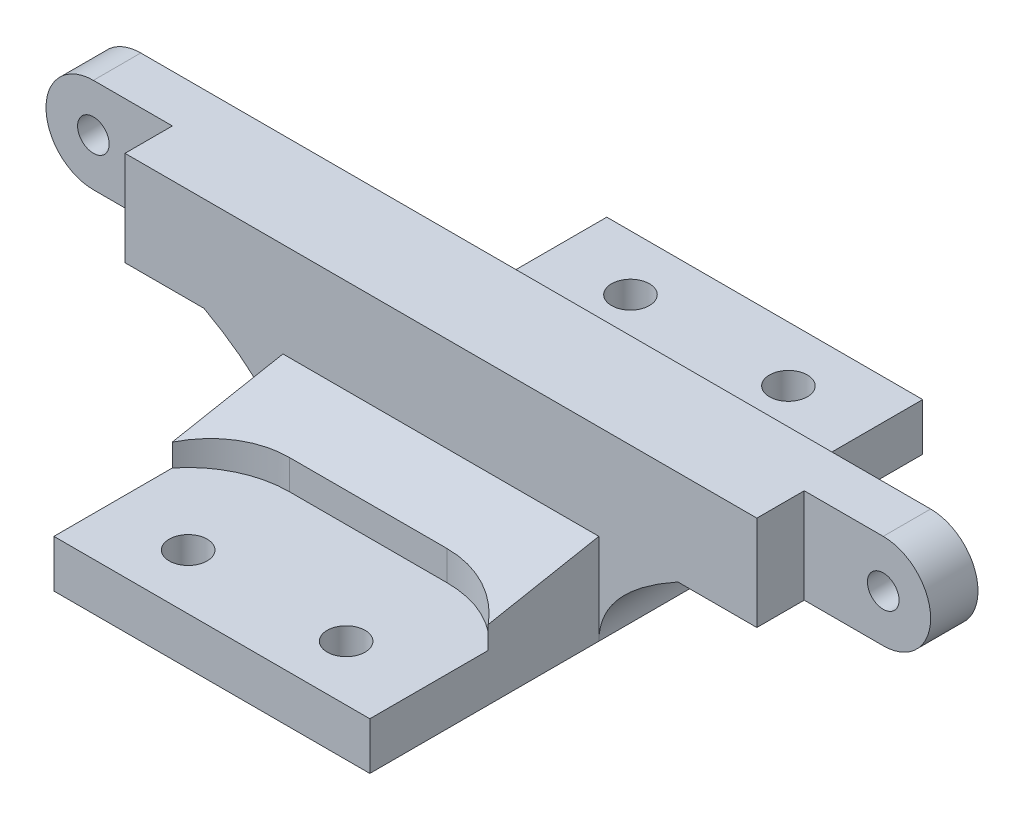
ISO-10303-21;
HEADER;
FILE_DESCRIPTION(('STEP AP214'),'2;1');
FILE_NAME('part.step','',(''),(''),'','','');
FILE_SCHEMA(('AUTOMOTIVE_DESIGN { 1 0 10303 214 1 1 1 1 }'));
ENDSEC;
DATA;
#1=APPLICATION_CONTEXT('core data for automotive mechanical design processes');
#2=APPLICATION_PROTOCOL_DEFINITION('international standard','automotive_design',2000,#1);
#3=PRODUCT_CONTEXT('',#1,'mechanical');
#4=PRODUCT('Part','Part','',(#3));
#5=PRODUCT_RELATED_PRODUCT_CATEGORY('part','',(#4));
#6=PRODUCT_DEFINITION_FORMATION('','',#4);
#7=PRODUCT_DEFINITION_CONTEXT('part definition',#1,'design');
#8=PRODUCT_DEFINITION('design','',#6,#7);
#9=PRODUCT_DEFINITION_SHAPE('','',#8);
#10=(LENGTH_UNIT() NAMED_UNIT(*) SI_UNIT(.MILLI.,.METRE.));
#11=(NAMED_UNIT(*) PLANE_ANGLE_UNIT() SI_UNIT($,.RADIAN.));
#12=(NAMED_UNIT(*) SI_UNIT($,.STERADIAN.) SOLID_ANGLE_UNIT());
#13=UNCERTAINTY_MEASURE_WITH_UNIT(LENGTH_MEASURE(1.E-05),#10,'distance_accuracy_value','');
#14=(GEOMETRIC_REPRESENTATION_CONTEXT(3) GLOBAL_UNCERTAINTY_ASSIGNED_CONTEXT((#13)) GLOBAL_UNIT_ASSIGNED_CONTEXT((#10,
#11,#12)) REPRESENTATION_CONTEXT('',''));
#15=CARTESIAN_POINT('',(0.,0.,0.));
#16=DIRECTION('',(0.,0.,1.));
#17=DIRECTION('',(1.,0.,0.));
#18=AXIS2_PLACEMENT_3D('',#15,#16,#17);
#19=CARTESIAN_POINT('',(12.7,0.,3.81));
#20=DIRECTION('',(1.,0.,0.));
#21=DIRECTION('',(0.,1.,0.));
#22=AXIS2_PLACEMENT_3D('',#19,#20,#21);
#23=PLANE('',#22);
#24=DIRECTION('',(0.,0.186333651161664,0.982486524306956));
#25=VECTOR('',#24,1.);
#26=CARTESIAN_POINT('',(12.7,3.81,-22.225));
#27=LINE('',#26,#25);
#28=CARTESIAN_POINT('',(12.7,5.61526045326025,-12.7063539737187));
#29=VERTEX_POINT('',#28);
#30=CARTESIAN_POINT('',(12.7,7.3025,-3.81));
#31=VERTEX_POINT('',#30);
#32=EDGE_CURVE('E443',#29,#31,#27,.T.);
#33=ORIENTED_EDGE('',*,*,#32,.T.);
#34=DIRECTION('',(0.,-1.,0.));
#35=VECTOR('',#34,1.);
#36=CARTESIAN_POINT('',(12.7,7.3025,-3.81));
#37=LINE('',#36,#35);
#38=CARTESIAN_POINT('',(12.7,0.,-3.81));
#39=VERTEX_POINT('',#38);
#40=EDGE_CURVE('E54',#31,#39,#37,.T.);
#41=ORIENTED_EDGE('',*,*,#40,.T.);
#42=DIRECTION('',(0.,0.,-1.));
#43=VECTOR('',#42,1.);
#44=CARTESIAN_POINT('',(12.7,0.,3.81));
#45=LINE('',#44,#43);
#46=CARTESIAN_POINT('',(12.7,0.,-22.225));
#47=VERTEX_POINT('',#46);
#48=EDGE_CURVE('E500',#39,#47,#45,.T.);
#49=ORIENTED_EDGE('',*,*,#48,.T.);
#50=DIRECTION('',(0.,1.,0.));
#51=VECTOR('',#50,1.);
#52=CARTESIAN_POINT('',(12.7,0.,-22.225));
#53=LINE('',#52,#51);
#54=CARTESIAN_POINT('',(12.7,3.81,-22.225));
#55=VERTEX_POINT('',#54);
#56=EDGE_CURVE('E449',#47,#55,#53,.T.);
#57=ORIENTED_EDGE('',*,*,#56,.T.);
#58=DIRECTION('',(0.,0.,-1.));
#59=VECTOR('',#58,1.);
#60=CARTESIAN_POINT('',(12.7,3.81,3.81));
#61=LINE('',#60,#59);
#62=CARTESIAN_POINT('',(12.7,3.81,-12.7063539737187));
#63=VERTEX_POINT('',#62);
#64=EDGE_CURVE('E628',#63,#55,#61,.T.);
#65=ORIENTED_EDGE('',*,*,#64,.F.);
#66=DIRECTION('',(0.,1.,0.));
#67=VECTOR('',#66,1.);
#68=CARTESIAN_POINT('',(12.7,3.81,-12.7063539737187));
#69=LINE('',#68,#67);
#70=EDGE_CURVE('E446',#29,#63,#69,.F.);
#71=ORIENTED_EDGE('',*,*,#70,.F.);
#72=EDGE_LOOP('',(#33,#41,#49,#57,#65,#71));
#73=FACE_BOUND('',#72,.T.);
#74=ADVANCED_FACE('F37',(#73),#23,.T.);
#75=CARTESIAN_POINT('',(0.,7.3025,3.81));
#76=DIRECTION('',(0.,1.,0.));
#77=DIRECTION('',(0.,0.,1.));
#78=AXIS2_PLACEMENT_3D('',#75,#76,#77);
#79=PLANE('',#78);
#80=DIRECTION('',(0.,0.,-1.));
#81=VECTOR('',#80,1.);
#82=CARTESIAN_POINT('',(19.05,7.3025,3.81));
#83=LINE('',#82,#81);
#84=CARTESIAN_POINT('',(19.05,7.3025,3.81));
#85=VERTEX_POINT('',#84);
#86=CARTESIAN_POINT('',(19.05,7.3025,-3.81));
#87=VERTEX_POINT('',#86);
#88=EDGE_CURVE('E251',#85,#87,#83,.T.);
#89=ORIENTED_EDGE('',*,*,#88,.T.);
#90=DIRECTION('',(1.,0.,0.));
#91=VECTOR('',#90,1.);
#92=CARTESIAN_POINT('',(0.,7.3025,-3.81));
#93=LINE('',#92,#91);
#94=CARTESIAN_POINT('',(31.75,7.3025,-3.81));
#95=VERTEX_POINT('',#94);
#96=EDGE_CURVE('E236',#87,#95,#93,.T.);
#97=ORIENTED_EDGE('',*,*,#96,.T.);
#98=DIRECTION('',(0.,0.,-1.));
#99=VECTOR('',#98,1.);
#100=CARTESIAN_POINT('',(31.75,7.3025,3.81));
#101=LINE('',#100,#99);
#102=CARTESIAN_POINT('',(31.75,7.3025,0.));
#103=VERTEX_POINT('',#102);
#104=EDGE_CURVE('E510',#103,#95,#101,.T.);
#105=ORIENTED_EDGE('',*,*,#104,.F.);
#106=DIRECTION('',(-1.,0.,0.));
#107=VECTOR('',#106,1.);
#108=CARTESIAN_POINT('',(0.,7.3025,0.));
#109=LINE('',#108,#107);
#110=CARTESIAN_POINT('',(25.4,7.3025,0.));
#111=VERTEX_POINT('',#110);
#112=EDGE_CURVE('E570',#103,#111,#109,.T.);
#113=ORIENTED_EDGE('',*,*,#112,.T.);
#114=DIRECTION('',(0.,0.,1.));
#115=VECTOR('',#114,1.);
#116=CARTESIAN_POINT('',(25.4,7.3025,3.81));
#117=LINE('',#116,#115);
#118=CARTESIAN_POINT('',(25.4,7.3025,3.81));
#119=VERTEX_POINT('',#118);
#120=EDGE_CURVE('E554',#111,#119,#117,.T.);
#121=ORIENTED_EDGE('',*,*,#120,.T.);
#122=DIRECTION('',(1.,0.,0.));
#123=VECTOR('',#122,1.);
#124=CARTESIAN_POINT('',(0.,7.3025,3.81));
#125=LINE('',#124,#123);
#126=EDGE_CURVE('E254',#85,#119,#125,.T.);
#127=ORIENTED_EDGE('',*,*,#126,.F.);
#128=EDGE_LOOP('',(#89,#97,#105,#113,#121,#127));
#129=FACE_BOUND('',#128,.T.);
#130=ADVANCED_FACE('F252',(#129),#79,.F.);
#131=DIRECTION('',(0.,0.,-1.));
#132=VECTOR('',#131,1.);
#133=CARTESIAN_POINT('',(-19.05,7.3025,3.81));
#134=LINE('',#133,#132);
#135=CARTESIAN_POINT('',(-19.05,7.3025,3.81));
#136=VERTEX_POINT('',#135);
#137=CARTESIAN_POINT('',(-19.05,7.3025,-3.81));
#138=VERTEX_POINT('',#137);
#139=EDGE_CURVE('E693',#136,#138,#134,.T.);
#140=ORIENTED_EDGE('',*,*,#139,.F.);
#141=CARTESIAN_POINT('',(-25.4,7.3025,3.81));
#142=VERTEX_POINT('',#141);
#143=EDGE_CURVE('E488',#142,#136,#125,.T.);
#144=ORIENTED_EDGE('',*,*,#143,.F.);
#145=DIRECTION('',(0.,0.,-1.));
#146=VECTOR('',#145,1.);
#147=CARTESIAN_POINT('',(-25.4,7.3025,3.81));
#148=LINE('',#147,#146);
#149=CARTESIAN_POINT('',(-25.4,7.3025,0.));
#150=VERTEX_POINT('',#149);
#151=EDGE_CURVE('E561',#142,#150,#148,.T.);
#152=ORIENTED_EDGE('',*,*,#151,.T.);
#153=DIRECTION('',(-1.,0.,0.));
#154=VECTOR('',#153,1.);
#155=CARTESIAN_POINT('',(0.,7.3025,0.));
#156=LINE('',#155,#154);
#157=CARTESIAN_POINT('',(-31.75,7.3025,0.));
#158=VERTEX_POINT('',#157);
#159=EDGE_CURVE('E11',#150,#158,#156,.T.);
#160=ORIENTED_EDGE('',*,*,#159,.T.);
#161=DIRECTION('',(0.,0.,-1.));
#162=VECTOR('',#161,1.);
#163=CARTESIAN_POINT('',(-31.75,7.3025,3.81));
#164=LINE('',#163,#162);
#165=CARTESIAN_POINT('',(-31.75,7.3025,-3.81));
#166=VERTEX_POINT('',#165);
#167=EDGE_CURVE('E504',#158,#166,#164,.T.);
#168=ORIENTED_EDGE('',*,*,#167,.T.);
#169=EDGE_CURVE('E249',#166,#138,#93,.T.);
#170=ORIENTED_EDGE('',*,*,#169,.T.);
#171=EDGE_LOOP('',(#140,#144,#152,#160,#168,#170));
#172=FACE_BOUND('',#171,.T.);
#173=ADVANCED_FACE('F417',(#172),#79,.F.);
#174=CARTESIAN_POINT('',(-12.7,0.,3.81));
#175=DIRECTION('',(1.,0.,0.));
#176=DIRECTION('',(0.,1.,0.));
#177=AXIS2_PLACEMENT_3D('',#174,#175,#176);
#178=PLANE('',#177);
#179=DIRECTION('',(0.,1.,0.));
#180=VECTOR('',#179,1.);
#181=CARTESIAN_POINT('',(-12.7,7.3025,3.81));
#182=LINE('',#181,#180);
#183=CARTESIAN_POINT('',(-12.7,0.,3.81));
#184=VERTEX_POINT('',#183);
#185=CARTESIAN_POINT('',(-12.7,7.3025,3.81));
#186=VERTEX_POINT('',#185);
#187=EDGE_CURVE('E280',#184,#186,#182,.T.);
#188=ORIENTED_EDGE('',*,*,#187,.F.);
#189=DIRECTION('',(0.,0.,-1.));
#190=VECTOR('',#189,1.);
#191=CARTESIAN_POINT('',(-12.7,0.,3.81));
#192=LINE('',#191,#190);
#193=CARTESIAN_POINT('',(-12.7,0.,22.225));
#194=VERTEX_POINT('',#193);
#195=EDGE_CURVE('E501',#194,#184,#192,.T.);
#196=ORIENTED_EDGE('',*,*,#195,.F.);
#197=DIRECTION('',(0.,-1.,0.));
#198=VECTOR('',#197,1.);
#199=CARTESIAN_POINT('',(-12.7,0.,22.225));
#200=LINE('',#199,#198);
#201=CARTESIAN_POINT('',(-12.7,3.81,22.225));
#202=VERTEX_POINT('',#201);
#203=EDGE_CURVE('E471',#202,#194,#200,.T.);
#204=ORIENTED_EDGE('',*,*,#203,.F.);
#205=DIRECTION('',(0.,0.,1.));
#206=VECTOR('',#205,1.);
#207=CARTESIAN_POINT('',(-12.7,3.81,3.81));
#208=LINE('',#207,#206);
#209=CARTESIAN_POINT('',(-12.7,3.81,12.7063539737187));
#210=VERTEX_POINT('',#209);
#211=EDGE_CURVE('E634',#210,#202,#208,.T.);
#212=ORIENTED_EDGE('',*,*,#211,.F.);
#213=DIRECTION('',(0.,1.,0.));
#214=VECTOR('',#213,1.);
#215=CARTESIAN_POINT('',(-12.7,3.81,12.7063539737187));
#216=LINE('',#215,#214);
#217=CARTESIAN_POINT('',(-12.7,5.61526045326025,12.7063539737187));
#218=VERTEX_POINT('',#217);
#219=EDGE_CURVE('E641',#210,#218,#216,.T.);
#220=ORIENTED_EDGE('',*,*,#219,.T.);
#221=DIRECTION('',(0.,-0.186333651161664,0.982486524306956));
#222=VECTOR('',#221,1.);
#223=CARTESIAN_POINT('',(-12.7,3.81,22.225));
#224=LINE('',#223,#222);
#225=EDGE_CURVE('E461',#186,#218,#224,.T.);
#226=ORIENTED_EDGE('',*,*,#225,.F.);
#227=EDGE_LOOP('',(#188,#196,#204,#212,#220,#226));
#228=FACE_BOUND('',#227,.T.);
#229=ADVANCED_FACE('F416',(#228),#178,.F.);
#230=DIRECTION('',(0.,-1.,0.));
#231=VECTOR('',#230,1.);
#232=CARTESIAN_POINT('',(12.7,7.3025,3.81));
#233=LINE('',#232,#231);
#234=CARTESIAN_POINT('',(12.7,7.3025,3.81));
#235=VERTEX_POINT('',#234);
#236=CARTESIAN_POINT('',(12.7,0.,3.81));
#237=VERTEX_POINT('',#236);
#238=EDGE_CURVE('E267',#235,#237,#233,.T.);
#239=ORIENTED_EDGE('',*,*,#238,.F.);
#240=DIRECTION('',(0.,-0.186333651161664,0.982486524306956));
#241=VECTOR('',#240,1.);
#242=CARTESIAN_POINT('',(12.7,3.81,22.225));
#243=LINE('',#242,#241);
#244=CARTESIAN_POINT('',(12.7,5.61526045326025,12.7063539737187));
#245=VERTEX_POINT('',#244);
#246=EDGE_CURVE('E467',#235,#245,#243,.T.);
#247=ORIENTED_EDGE('',*,*,#246,.T.);
#248=DIRECTION('',(0.,1.,0.));
#249=VECTOR('',#248,1.);
#250=CARTESIAN_POINT('',(12.7,3.81,12.7063539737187));
#251=LINE('',#250,#249);
#252=CARTESIAN_POINT('',(12.7,3.81,12.7063539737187));
#253=VERTEX_POINT('',#252);
#254=EDGE_CURVE('E639',#253,#245,#251,.T.);
#255=ORIENTED_EDGE('',*,*,#254,.F.);
#256=DIRECTION('',(0.,0.,1.));
#257=VECTOR('',#256,1.);
#258=CARTESIAN_POINT('',(12.7,3.81,3.81));
#259=LINE('',#258,#257);
#260=CARTESIAN_POINT('',(12.7,3.81,22.225));
#261=VERTEX_POINT('',#260);
#262=EDGE_CURVE('E636',#253,#261,#259,.T.);
#263=ORIENTED_EDGE('',*,*,#262,.T.);
#264=DIRECTION('',(0.,-1.,0.));
#265=VECTOR('',#264,1.);
#266=CARTESIAN_POINT('',(12.7,0.,22.225));
#267=LINE('',#266,#265);
#268=CARTESIAN_POINT('',(12.7,0.,22.225));
#269=VERTEX_POINT('',#268);
#270=EDGE_CURVE('E470',#261,#269,#267,.T.);
#271=ORIENTED_EDGE('',*,*,#270,.T.);
#272=EDGE_CURVE('E497',#269,#237,#45,.T.);
#273=ORIENTED_EDGE('',*,*,#272,.T.);
#274=EDGE_LOOP('',(#239,#247,#255,#263,#271,#273));
#275=FACE_BOUND('',#274,.T.);
#276=ADVANCED_FACE('F39',(#275),#23,.T.);
#277=CARTESIAN_POINT('',(31.75,11.1125,3.81));
#278=DIRECTION('',(0.,0.,-1.));
#279=DIRECTION('',(-1.,0.,0.));
#280=AXIS2_PLACEMENT_3D('',#277,#278,#279);
#281=CYLINDRICAL_SURFACE('',#280,3.81);
#282=DIRECTION('',(0.,0.,-1.));
#283=VECTOR('',#282,1.);
#284=CARTESIAN_POINT('',(31.75,14.9225,3.81));
#285=LINE('',#284,#283);
#286=CARTESIAN_POINT('',(31.75,14.9225,0.));
#287=VERTEX_POINT('',#286);
#288=CARTESIAN_POINT('',(31.75,14.9225,-3.81));
#289=VERTEX_POINT('',#288);
#290=EDGE_CURVE('E508',#287,#289,#285,.T.);
#291=ORIENTED_EDGE('',*,*,#290,.F.);
#292=CARTESIAN_POINT('',(31.75,11.1125,0.));
#293=DIRECTION('',(0.,0.,-1.));
#294=DIRECTION('',(-1.,0.,0.));
#295=AXIS2_PLACEMENT_3D('',#292,#293,#294);
#296=CIRCLE('',#295,3.81);
#297=EDGE_CURVE('E567',#287,#103,#296,.T.);
#298=ORIENTED_EDGE('',*,*,#297,.T.);
#299=ORIENTED_EDGE('',*,*,#104,.T.);
#300=CARTESIAN_POINT('',(31.75,11.1125,-3.81));
#301=DIRECTION('',(0.,0.,1.));
#302=DIRECTION('',(1.,0.,0.));
#303=AXIS2_PLACEMENT_3D('',#300,#301,#302);
#304=CIRCLE('',#303,3.81);
#305=EDGE_CURVE('E243',#95,#289,#304,.T.);
#306=ORIENTED_EDGE('',*,*,#305,.T.);
#307=EDGE_LOOP('',(#291,#298,#299,#306));
#308=FACE_BOUND('',#307,.T.);
#309=ADVANCED_FACE('F426',(#308),#281,.T.);
#310=CARTESIAN_POINT('',(0.,14.9225,3.81));
#311=DIRECTION('',(0.,1.,0.));
#312=DIRECTION('',(0.,0.,1.));
#313=AXIS2_PLACEMENT_3D('',#310,#311,#312);
#314=PLANE('',#313);
#315=DIRECTION('',(-1.,0.,0.));
#316=VECTOR('',#315,1.);
#317=CARTESIAN_POINT('',(-39.2549699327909,14.9225,0.));
#318=LINE('',#317,#316);
#319=CARTESIAN_POINT('',(-25.4,14.9225,0.));
#320=VERTEX_POINT('',#319);
#321=CARTESIAN_POINT('',(-31.75,14.9225,0.));
#322=VERTEX_POINT('',#321);
#323=EDGE_CURVE('E549',#320,#322,#318,.T.);
#324=ORIENTED_EDGE('',*,*,#323,.F.);
#325=DIRECTION('',(0.,0.,-1.));
#326=VECTOR('',#325,1.);
#327=CARTESIAN_POINT('',(-25.4,14.9225,0.));
#328=LINE('',#327,#326);
#329=CARTESIAN_POINT('',(-25.4,14.9225,3.81));
#330=VERTEX_POINT('',#329);
#331=EDGE_CURVE('E546',#330,#320,#328,.T.);
#332=ORIENTED_EDGE('',*,*,#331,.F.);
#333=DIRECTION('',(1.,0.,0.));
#334=VECTOR('',#333,1.);
#335=CARTESIAN_POINT('',(0.,14.9225,3.81));
#336=LINE('',#335,#334);
#337=CARTESIAN_POINT('',(25.4,14.9225,3.81));
#338=VERTEX_POINT('',#337);
#339=EDGE_CURVE('E487',#330,#338,#336,.T.);
#340=ORIENTED_EDGE('',*,*,#339,.T.);
#341=DIRECTION('',(0.,0.,1.));
#342=VECTOR('',#341,1.);
#343=CARTESIAN_POINT('',(25.4,14.9225,0.));
#344=LINE('',#343,#342);
#345=CARTESIAN_POINT('',(25.4,14.9225,0.));
#346=VERTEX_POINT('',#345);
#347=EDGE_CURVE('E557',#346,#338,#344,.T.);
#348=ORIENTED_EDGE('',*,*,#347,.F.);
#349=DIRECTION('',(-1.,0.,0.));
#350=VECTOR('',#349,1.);
#351=CARTESIAN_POINT('',(44.8262805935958,14.9225,0.));
#352=LINE('',#351,#350);
#353=EDGE_CURVE('E535',#287,#346,#352,.T.);
#354=ORIENTED_EDGE('',*,*,#353,.F.);
#355=ORIENTED_EDGE('',*,*,#290,.T.);
#356=DIRECTION('',(1.,0.,0.));
#357=VECTOR('',#356,1.);
#358=CARTESIAN_POINT('',(0.,14.9225,-3.81));
#359=LINE('',#358,#357);
#360=CARTESIAN_POINT('',(-31.75,14.9225,-3.81));
#361=VERTEX_POINT('',#360);
#362=EDGE_CURVE('E492',#361,#289,#359,.T.);
#363=ORIENTED_EDGE('',*,*,#362,.F.);
#364=DIRECTION('',(0.,0.,-1.));
#365=VECTOR('',#364,1.);
#366=CARTESIAN_POINT('',(-31.75,14.9225,3.81));
#367=LINE('',#366,#365);
#368=EDGE_CURVE('E506',#322,#361,#367,.T.);
#369=ORIENTED_EDGE('',*,*,#368,.F.);
#370=EDGE_LOOP('',(#324,#332,#340,#348,#354,#355,#363,#369));
#371=FACE_BOUND('',#370,.T.);
#372=ADVANCED_FACE('F423',(#371),#314,.T.);
#373=CARTESIAN_POINT('',(-31.75,11.1125,3.81));
#374=DIRECTION('',(0.,0.,-1.));
#375=DIRECTION('',(-1.,0.,0.));
#376=AXIS2_PLACEMENT_3D('',#373,#374,#375);
#377=CYLINDRICAL_SURFACE('',#376,3.81);
#378=ORIENTED_EDGE('',*,*,#167,.F.);
#379=CARTESIAN_POINT('',(-31.75,11.1125,0.));
#380=DIRECTION('',(0.,0.,-1.));
#381=DIRECTION('',(-1.,0.,0.));
#382=AXIS2_PLACEMENT_3D('',#379,#380,#381);
#383=CIRCLE('',#382,3.81);
#384=EDGE_CURVE('E564',#158,#322,#383,.T.);
#385=ORIENTED_EDGE('',*,*,#384,.T.);
#386=ORIENTED_EDGE('',*,*,#368,.T.);
#387=CARTESIAN_POINT('',(-31.75,11.1125,-3.81));
#388=DIRECTION('',(0.,0.,1.));
#389=DIRECTION('',(1.,0.,0.));
#390=AXIS2_PLACEMENT_3D('',#387,#388,#389);
#391=CIRCLE('',#390,3.81);
#392=EDGE_CURVE('E494',#361,#166,#391,.T.);
#393=ORIENTED_EDGE('',*,*,#392,.T.);
#394=EDGE_LOOP('',(#378,#385,#386,#393));
#395=FACE_BOUND('',#394,.T.);
#396=ADVANCED_FACE('F414',(#395),#377,.T.);
#397=CARTESIAN_POINT('',(-12.7,0.,-3.81));
#398=VERTEX_POINT('',#397);
#399=CARTESIAN_POINT('',(-12.7,0.,-22.225));
#400=VERTEX_POINT('',#399);
#401=EDGE_CURVE('E499',#398,#400,#192,.T.);
#402=ORIENTED_EDGE('',*,*,#401,.F.);
#403=DIRECTION('',(0.,1.,0.));
#404=VECTOR('',#403,1.);
#405=CARTESIAN_POINT('',(-12.7,7.3025,-3.81));
#406=LINE('',#405,#404);
#407=CARTESIAN_POINT('',(-12.7,7.3025,-3.81));
#408=VERTEX_POINT('',#407);
#409=EDGE_CURVE('E281',#398,#408,#406,.T.);
#410=ORIENTED_EDGE('',*,*,#409,.T.);
#411=DIRECTION('',(0.,0.186333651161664,0.982486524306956));
#412=VECTOR('',#411,1.);
#413=CARTESIAN_POINT('',(-12.7,3.81,-22.225));
#414=LINE('',#413,#412);
#415=CARTESIAN_POINT('',(-12.7,5.61526045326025,-12.7063539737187));
#416=VERTEX_POINT('',#415);
#417=EDGE_CURVE('E456',#416,#408,#414,.T.);
#418=ORIENTED_EDGE('',*,*,#417,.F.);
#419=DIRECTION('',(0.,1.,0.));
#420=VECTOR('',#419,1.);
#421=CARTESIAN_POINT('',(-12.7,3.81,-12.7063539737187));
#422=LINE('',#421,#420);
#423=CARTESIAN_POINT('',(-12.7,3.81,-12.7063539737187));
#424=VERTEX_POINT('',#423);
#425=EDGE_CURVE('E631',#416,#424,#422,.F.);
#426=ORIENTED_EDGE('',*,*,#425,.T.);
#427=DIRECTION('',(0.,0.,-1.));
#428=VECTOR('',#427,1.);
#429=CARTESIAN_POINT('',(-12.7,3.81,3.81));
#430=LINE('',#429,#428);
#431=CARTESIAN_POINT('',(-12.7,3.81,-22.225));
#432=VERTEX_POINT('',#431);
#433=EDGE_CURVE('E611',#424,#432,#430,.T.);
#434=ORIENTED_EDGE('',*,*,#433,.T.);
#435=DIRECTION('',(0.,1.,0.));
#436=VECTOR('',#435,1.);
#437=CARTESIAN_POINT('',(-12.7,0.,-22.225));
#438=LINE('',#437,#436);
#439=EDGE_CURVE('E670',#400,#432,#438,.T.);
#440=ORIENTED_EDGE('',*,*,#439,.F.);
#441=EDGE_LOOP('',(#402,#410,#418,#426,#434,#440));
#442=FACE_BOUND('',#441,.T.);
#443=ADVANCED_FACE('F410',(#442),#178,.F.);
#444=CARTESIAN_POINT('',(0.,0.,3.81));
#445=DIRECTION('',(0.,1.,0.));
#446=DIRECTION('',(0.,0.,1.));
#447=AXIS2_PLACEMENT_3D('',#444,#445,#446);
#448=PLANE('',#447);
#449=CARTESIAN_POINT('',(-6.35,0.,-17.78));
#450=DIRECTION('',(0.,1.,0.));
#451=DIRECTION('',(0.,0.,-1.));
#452=AXIS2_PLACEMENT_3D('',#449,#450,#451);
#453=CIRCLE('',#452,1.524);
#454=CARTESIAN_POINT('',(-6.35,0.,-16.256));
#455=VERTEX_POINT('',#454);
#456=EDGE_CURVE('E587',#455,#455,#453,.T.);
#457=ORIENTED_EDGE('',*,*,#456,.T.);
#458=EDGE_LOOP('',(#457));
#459=FACE_BOUND('',#458,.T.);
#460=CARTESIAN_POINT('',(6.35,0.,-17.78));
#461=DIRECTION('',(0.,1.,0.));
#462=DIRECTION('',(0.,0.,-1.));
#463=AXIS2_PLACEMENT_3D('',#460,#461,#462);
#464=CIRCLE('',#463,1.524);
#465=CARTESIAN_POINT('',(6.35,0.,-16.256));
#466=VERTEX_POINT('',#465);
#467=EDGE_CURVE('E581',#466,#466,#464,.T.);
#468=ORIENTED_EDGE('',*,*,#467,.T.);
#469=EDGE_LOOP('',(#468));
#470=FACE_BOUND('',#469,.T.);
#471=CARTESIAN_POINT('',(6.35,0.,17.78));
#472=DIRECTION('',(0.,1.,0.));
#473=DIRECTION('',(0.,0.,1.));
#474=AXIS2_PLACEMENT_3D('',#471,#472,#473);
#475=CIRCLE('',#474,1.524);
#476=CARTESIAN_POINT('',(6.35,0.,19.304));
#477=VERTEX_POINT('',#476);
#478=EDGE_CURVE('E574',#477,#477,#475,.T.);
#479=ORIENTED_EDGE('',*,*,#478,.T.);
#480=EDGE_LOOP('',(#479));
#481=FACE_BOUND('',#480,.T.);
#482=CARTESIAN_POINT('',(-6.35,0.,17.78));
#483=DIRECTION('',(0.,1.,0.));
#484=DIRECTION('',(0.,0.,1.));
#485=AXIS2_PLACEMENT_3D('',#482,#483,#484);
#486=CIRCLE('',#485,1.524);
#487=CARTESIAN_POINT('',(-6.35,0.,19.304));
#488=VERTEX_POINT('',#487);
#489=EDGE_CURVE('E592',#488,#488,#486,.T.);
#490=ORIENTED_EDGE('',*,*,#489,.T.);
#491=EDGE_LOOP('',(#490));
#492=FACE_BOUND('',#491,.T.);
#493=DIRECTION('',(0.,0.,1.));
#494=VECTOR('',#493,1.);
#495=CARTESIAN_POINT('',(2.54,0.,-9.525));
#496=LINE('',#495,#494);
#497=CARTESIAN_POINT('',(2.54,0.,-9.525));
#498=VERTEX_POINT('',#497);
#499=CARTESIAN_POINT('',(2.54,0.,9.525));
#500=VERTEX_POINT('',#499);
#501=EDGE_CURVE('E660',#498,#500,#496,.T.);
#502=ORIENTED_EDGE('',*,*,#501,.F.);
#503=CARTESIAN_POINT('',(0.,0.,-9.525));
#504=DIRECTION('',(0.,-1.,0.));
#505=DIRECTION('',(0.,0.,-1.));
#506=AXIS2_PLACEMENT_3D('',#503,#504,#505);
#507=CIRCLE('',#506,2.54);
#508=CARTESIAN_POINT('',(-2.54,0.,-9.525));
#509=VERTEX_POINT('',#508);
#510=EDGE_CURVE('E644',#509,#498,#507,.T.);
#511=ORIENTED_EDGE('',*,*,#510,.F.);
#512=DIRECTION('',(0.,0.,-1.));
#513=VECTOR('',#512,1.);
#514=CARTESIAN_POINT('',(-2.54,0.,-9.525));
#515=LINE('',#514,#513);
#516=CARTESIAN_POINT('',(-2.54,0.,9.525));
#517=VERTEX_POINT('',#516);
#518=EDGE_CURVE('E649',#517,#509,#515,.T.);
#519=ORIENTED_EDGE('',*,*,#518,.F.);
#520=CARTESIAN_POINT('',(0.,0.,9.525));
#521=DIRECTION('',(0.,-1.,0.));
#522=DIRECTION('',(0.,0.,-1.));
#523=AXIS2_PLACEMENT_3D('',#520,#521,#522);
#524=CIRCLE('',#523,2.54);
#525=EDGE_CURVE('E663',#500,#517,#524,.T.);
#526=ORIENTED_EDGE('',*,*,#525,.F.);
#527=EDGE_LOOP('',(#502,#511,#519,#526));
#528=FACE_BOUND('',#527,.T.);
#529=ORIENTED_EDGE('',*,*,#195,.T.);
#530=DIRECTION('',(0.,0.,-1.));
#531=VECTOR('',#530,1.);
#532=CARTESIAN_POINT('',(-12.7,0.,3.81));
#533=LINE('',#532,#531);
#534=EDGE_CURVE('E541',#184,#398,#533,.T.);
#535=ORIENTED_EDGE('',*,*,#534,.T.);
#536=ORIENTED_EDGE('',*,*,#401,.T.);
#537=DIRECTION('',(-1.,0.,0.));
#538=VECTOR('',#537,1.);
#539=CARTESIAN_POINT('',(12.7,0.,-22.225));
#540=LINE('',#539,#538);
#541=EDGE_CURVE('E448',#47,#400,#540,.T.);
#542=ORIENTED_EDGE('',*,*,#541,.F.);
#543=ORIENTED_EDGE('',*,*,#48,.F.);
#544=DIRECTION('',(0.,0.,-1.));
#545=VECTOR('',#544,1.);
#546=CARTESIAN_POINT('',(12.7,0.,3.81));
#547=LINE('',#546,#545);
#548=EDGE_CURVE('E61',#237,#39,#547,.T.);
#549=ORIENTED_EDGE('',*,*,#548,.F.);
#550=ORIENTED_EDGE('',*,*,#272,.F.);
#551=DIRECTION('',(-1.,0.,0.));
#552=VECTOR('',#551,1.);
#553=CARTESIAN_POINT('',(12.7,0.,22.225));
#554=LINE('',#553,#552);
#555=EDGE_CURVE('E474',#269,#194,#554,.T.);
#556=ORIENTED_EDGE('',*,*,#555,.T.);
#557=EDGE_LOOP('',(#529,#535,#536,#542,#543,#549,#550,#556));
#558=FACE_BOUND('',#557,.T.);
#559=ADVANCED_FACE('F403',(#459,#470,#481,#492,#528,#558),#448,.F.);
#560=CARTESIAN_POINT('',(0.,0.,3.81));
#561=DIRECTION('',(0.,0.,1.));
#562=DIRECTION('',(1.,0.,0.));
#563=AXIS2_PLACEMENT_3D('',#560,#561,#562);
#564=PLANE('',#563);
#565=DIRECTION('',(0.,1.,0.));
#566=VECTOR('',#565,1.);
#567=CARTESIAN_POINT('',(-25.4,0.,3.81));
#568=LINE('',#567,#566);
#569=EDGE_CURVE('E46',#142,#330,#568,.T.);
#570=ORIENTED_EDGE('',*,*,#569,.F.);
#571=ORIENTED_EDGE('',*,*,#143,.T.);
#572=CARTESIAN_POINT('',(-19.05,7.3025,3.81));
#573=CARTESIAN_POINT('',(-12.7,3.81,3.81));
#574=CARTESIAN_POINT('',(-12.7,0.,3.81));
#575=B_SPLINE_CURVE_WITH_KNOTS('',2,(#572,#573,#574),.UNSPECIFIED.,.F.,.F.,(3,3),(0.,1.),.UNSPECIFIED.);
#576=EDGE_CURVE('E274',#136,#184,#575,.T.);
#577=ORIENTED_EDGE('',*,*,#576,.T.);
#578=ORIENTED_EDGE('',*,*,#187,.T.);
#579=DIRECTION('',(-1.,0.,0.));
#580=VECTOR('',#579,1.);
#581=CARTESIAN_POINT('',(12.7,7.3025,3.81));
#582=LINE('',#581,#580);
#583=EDGE_CURVE('E247',#235,#186,#582,.T.);
#584=ORIENTED_EDGE('',*,*,#583,.F.);
#585=ORIENTED_EDGE('',*,*,#238,.T.);
#586=CARTESIAN_POINT('',(12.7,0.,3.81));
#587=CARTESIAN_POINT('',(12.7,3.81,3.81));
#588=CARTESIAN_POINT('',(19.05,7.3025,3.81));
#589=B_SPLINE_CURVE_WITH_KNOTS('',2,(#586,#587,#588),.UNSPECIFIED.,.F.,.F.,(3,3),(0.,1.),.UNSPECIFIED.);
#590=EDGE_CURVE('E262',#237,#85,#589,.T.);
#591=ORIENTED_EDGE('',*,*,#590,.T.);
#592=ORIENTED_EDGE('',*,*,#126,.T.);
#593=DIRECTION('',(0.,-1.,0.));
#594=VECTOR('',#593,1.);
#595=CARTESIAN_POINT('',(25.4,0.,3.81));
#596=LINE('',#595,#594);
#597=EDGE_CURVE('E527',#338,#119,#596,.T.);
#598=ORIENTED_EDGE('',*,*,#597,.F.);
#599=ORIENTED_EDGE('',*,*,#339,.F.);
#600=EDGE_LOOP('',(#570,#571,#577,#578,#584,#585,#591,#592,#598,#599));
#601=FACE_BOUND('',#600,.T.);
#602=ADVANCED_FACE('F400',(#601),#564,.T.);
#603=CARTESIAN_POINT('',(0.,0.,-3.81));
#604=DIRECTION('',(0.,0.,1.));
#605=DIRECTION('',(1.,0.,0.));
#606=AXIS2_PLACEMENT_3D('',#603,#604,#605);
#607=PLANE('',#606);
#608=CARTESIAN_POINT('',(31.75,11.1125,-3.81));
#609=DIRECTION('',(0.,0.,-1.));
#610=DIRECTION('',(-1.,0.,0.));
#611=AXIS2_PLACEMENT_3D('',#608,#609,#610);
#612=CIRCLE('',#611,1.27);
#613=CARTESIAN_POINT('',(30.48,11.1125,-3.81));
#614=VERTEX_POINT('',#613);
#615=EDGE_CURVE('E532',#614,#614,#612,.T.);
#616=ORIENTED_EDGE('',*,*,#615,.F.);
#617=EDGE_LOOP('',(#616));
#618=FACE_BOUND('',#617,.T.);
#619=CARTESIAN_POINT('',(-31.75,11.1125,-3.81));
#620=DIRECTION('',(0.,0.,-1.));
#621=DIRECTION('',(-1.,0.,0.));
#622=AXIS2_PLACEMENT_3D('',#619,#620,#621);
#623=CIRCLE('',#622,1.27);
#624=CARTESIAN_POINT('',(-33.02,11.1125,-3.81));
#625=VERTEX_POINT('',#624);
#626=EDGE_CURVE('E537',#625,#625,#623,.T.);
#627=ORIENTED_EDGE('',*,*,#626,.F.);
#628=EDGE_LOOP('',(#627));
#629=FACE_BOUND('',#628,.T.);
#630=ORIENTED_EDGE('',*,*,#96,.F.);
#631=CARTESIAN_POINT('',(12.7,0.,-3.81));
#632=CARTESIAN_POINT('',(12.7,3.81,-3.81));
#633=CARTESIAN_POINT('',(19.05,7.3025,-3.81));
#634=B_SPLINE_CURVE_WITH_KNOTS('',2,(#631,#632,#633),.UNSPECIFIED.,.F.,.F.,(3,3),(0.,1.),.UNSPECIFIED.);
#635=EDGE_CURVE('E240',#39,#87,#634,.T.);
#636=ORIENTED_EDGE('',*,*,#635,.F.);
#637=ORIENTED_EDGE('',*,*,#40,.F.);
#638=DIRECTION('',(-1.,0.,0.));
#639=VECTOR('',#638,1.);
#640=CARTESIAN_POINT('',(12.7,7.3025,-3.81));
#641=LINE('',#640,#639);
#642=EDGE_CURVE('E452',#31,#408,#641,.T.);
#643=ORIENTED_EDGE('',*,*,#642,.T.);
#644=ORIENTED_EDGE('',*,*,#409,.F.);
#645=CARTESIAN_POINT('',(-19.05,7.3025,-3.81));
#646=CARTESIAN_POINT('',(-12.7,3.81,-3.81));
#647=CARTESIAN_POINT('',(-12.7,0.,-3.81));
#648=B_SPLINE_CURVE_WITH_KNOTS('',2,(#645,#646,#647),.UNSPECIFIED.,.F.,.F.,(3,3),(0.,1.),.UNSPECIFIED.);
#649=EDGE_CURVE('E258',#138,#398,#648,.T.);
#650=ORIENTED_EDGE('',*,*,#649,.F.);
#651=ORIENTED_EDGE('',*,*,#169,.F.);
#652=ORIENTED_EDGE('',*,*,#392,.F.);
#653=ORIENTED_EDGE('',*,*,#362,.T.);
#654=ORIENTED_EDGE('',*,*,#305,.F.);
#655=EDGE_LOOP('',(#630,#636,#637,#643,#644,#650,#651,#652,#653,#654));
#656=FACE_BOUND('',#655,.T.);
#657=ADVANCED_FACE('F238',(#618,#629,#656),#607,.F.);
#658=CARTESIAN_POINT('',(12.7,3.81,22.225));
#659=DIRECTION('',(0.,-0.982486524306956,-0.186333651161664));
#660=DIRECTION('',(0.,0.186333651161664,-0.982486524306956));
#661=AXIS2_PLACEMENT_3D('',#658,#659,#660);
#662=PLANE('',#661);
#663=ORIENTED_EDGE('',*,*,#225,.T.);
#664=CARTESIAN_POINT('',(-6.35,4.65301724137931,17.78));
#665=DIRECTION('',(0.,-0.982486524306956,-0.186333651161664));
#666=DIRECTION('',(0.,0.186333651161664,-0.982486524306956));
#667=AXIS2_PLACEMENT_3D('',#664,#665,#666);
#668=ELLIPSE('',#667,8.27288700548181,8.12800000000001);
#669=CARTESIAN_POINT('',(-6.35,6.19453448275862,9.65199999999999));
#670=VERTEX_POINT('',#669);
#671=EDGE_CURVE('E524',#218,#670,#668,.T.);
#672=ORIENTED_EDGE('',*,*,#671,.T.);
#673=DIRECTION('',(1.,0.,0.));
#674=VECTOR('',#673,1.);
#675=CARTESIAN_POINT('',(12.7,6.19453448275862,9.65199999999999));
#676=LINE('',#675,#674);
#677=CARTESIAN_POINT('',(6.35,6.19453448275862,9.65199999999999));
#678=VERTEX_POINT('',#677);
#679=EDGE_CURVE('E521',#670,#678,#676,.T.);
#680=ORIENTED_EDGE('',*,*,#679,.T.);
#681=CARTESIAN_POINT('',(6.35,4.65301724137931,17.78));
#682=DIRECTION('',(0.,-0.982486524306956,-0.186333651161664));
#683=DIRECTION('',(0.,0.186333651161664,-0.982486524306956));
#684=AXIS2_PLACEMENT_3D('',#681,#682,#683);
#685=ELLIPSE('',#684,8.27288700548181,8.128);
#686=EDGE_CURVE('E518',#678,#245,#685,.T.);
#687=ORIENTED_EDGE('',*,*,#686,.T.);
#688=ORIENTED_EDGE('',*,*,#246,.F.);
#689=ORIENTED_EDGE('',*,*,#583,.T.);
#690=EDGE_LOOP('',(#663,#672,#680,#687,#688,#689));
#691=FACE_BOUND('',#690,.T.);
#692=ADVANCED_FACE('F395',(#691),#662,.F.);
#693=CARTESIAN_POINT('',(12.7,0.,22.225));
#694=DIRECTION('',(0.,0.,-1.));
#695=DIRECTION('',(-1.,0.,0.));
#696=AXIS2_PLACEMENT_3D('',#693,#694,#695);
#697=PLANE('',#696);
#698=ORIENTED_EDGE('',*,*,#203,.T.);
#699=ORIENTED_EDGE('',*,*,#555,.F.);
#700=ORIENTED_EDGE('',*,*,#270,.F.);
#701=DIRECTION('',(-1.,0.,0.));
#702=VECTOR('',#701,1.);
#703=CARTESIAN_POINT('',(12.7,3.81,22.225));
#704=LINE('',#703,#702);
#705=EDGE_CURVE('E481',#261,#202,#704,.T.);
#706=ORIENTED_EDGE('',*,*,#705,.T.);
#707=EDGE_LOOP('',(#698,#699,#700,#706));
#708=FACE_BOUND('',#707,.T.);
#709=ADVANCED_FACE('F391',(#708),#697,.F.);
#710=CARTESIAN_POINT('',(12.7,0.,-22.225));
#711=DIRECTION('',(0.,0.,1.));
#712=DIRECTION('',(1.,0.,0.));
#713=AXIS2_PLACEMENT_3D('',#710,#711,#712);
#714=PLANE('',#713);
#715=ORIENTED_EDGE('',*,*,#439,.T.);
#716=DIRECTION('',(-1.,0.,0.));
#717=VECTOR('',#716,1.);
#718=CARTESIAN_POINT('',(12.7,3.81,-22.225));
#719=LINE('',#718,#717);
#720=EDGE_CURVE('E459',#55,#432,#719,.T.);
#721=ORIENTED_EDGE('',*,*,#720,.F.);
#722=ORIENTED_EDGE('',*,*,#56,.F.);
#723=ORIENTED_EDGE('',*,*,#541,.T.);
#724=EDGE_LOOP('',(#715,#721,#722,#723));
#725=FACE_BOUND('',#724,.T.);
#726=ADVANCED_FACE('F387',(#725),#714,.F.);
#727=CARTESIAN_POINT('',(12.7,3.81,-22.225));
#728=DIRECTION('',(0.,-0.982486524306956,0.186333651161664));
#729=DIRECTION('',(0.,-0.186333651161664,-0.982486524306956));
#730=AXIS2_PLACEMENT_3D('',#727,#728,#729);
#731=PLANE('',#730);
#732=DIRECTION('',(-1.,0.,0.));
#733=VECTOR('',#732,1.);
#734=CARTESIAN_POINT('',(12.7,6.19453448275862,-9.65199999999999));
#735=LINE('',#734,#733);
#736=CARTESIAN_POINT('',(6.35,6.19453448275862,-9.65199999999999));
#737=VERTEX_POINT('',#736);
#738=CARTESIAN_POINT('',(-6.35000000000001,6.19453448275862,-9.65199999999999));
#739=VERTEX_POINT('',#738);
#740=EDGE_CURVE('E512',#737,#739,#735,.T.);
#741=ORIENTED_EDGE('',*,*,#740,.T.);
#742=CARTESIAN_POINT('',(-6.35,4.65301724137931,-17.78));
#743=DIRECTION('',(0.,-0.982486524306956,0.186333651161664));
#744=DIRECTION('',(0.,0.186333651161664,0.982486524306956));
#745=AXIS2_PLACEMENT_3D('',#742,#743,#744);
#746=ELLIPSE('',#745,8.27288700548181,8.12800000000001);
#747=EDGE_CURVE('E516',#739,#416,#746,.T.);
#748=ORIENTED_EDGE('',*,*,#747,.T.);
#749=ORIENTED_EDGE('',*,*,#417,.T.);
#750=ORIENTED_EDGE('',*,*,#642,.F.);
#751=ORIENTED_EDGE('',*,*,#32,.F.);
#752=CARTESIAN_POINT('',(6.35,4.65301724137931,-17.78));
#753=DIRECTION('',(0.,-0.982486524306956,0.186333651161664));
#754=DIRECTION('',(0.,0.186333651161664,0.982486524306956));
#755=AXIS2_PLACEMENT_3D('',#752,#753,#754);
#756=ELLIPSE('',#755,8.27288700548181,8.12800000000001);
#757=EDGE_CURVE('E514',#29,#737,#756,.T.);
#758=ORIENTED_EDGE('',*,*,#757,.T.);
#759=EDGE_LOOP('',(#741,#748,#749,#750,#751,#758));
#760=FACE_BOUND('',#759,.T.);
#761=ADVANCED_FACE('F383',(#760),#731,.F.);
#762=CARTESIAN_POINT('',(0.,2.54,-9.525));
#763=DIRECTION('',(0.,-1.,0.));
#764=DIRECTION('',(0.,0.,-1.));
#765=AXIS2_PLACEMENT_3D('',#762,#763,#764);
#766=CYLINDRICAL_SURFACE('',#765,2.54);
#767=ORIENTED_EDGE('',*,*,#510,.T.);
#768=DIRECTION('',(0.,-1.,0.));
#769=VECTOR('',#768,1.);
#770=CARTESIAN_POINT('',(2.54,2.54,-9.525));
#771=LINE('',#770,#769);
#772=CARTESIAN_POINT('',(2.54,2.54,-9.525));
#773=VERTEX_POINT('',#772);
#774=EDGE_CURVE('E658',#773,#498,#771,.T.);
#775=ORIENTED_EDGE('',*,*,#774,.F.);
#776=CARTESIAN_POINT('',(0.,2.54,-9.525));
#777=DIRECTION('',(0.,-1.,0.));
#778=DIRECTION('',(0.,0.,-1.));
#779=AXIS2_PLACEMENT_3D('',#776,#777,#778);
#780=CIRCLE('',#779,2.54);
#781=CARTESIAN_POINT('',(-2.54,2.54,-9.525));
#782=VERTEX_POINT('',#781);
#783=EDGE_CURVE('E645',#782,#773,#780,.T.);
#784=ORIENTED_EDGE('',*,*,#783,.F.);
#785=DIRECTION('',(0.,-1.,0.));
#786=VECTOR('',#785,1.);
#787=CARTESIAN_POINT('',(-2.54,2.54,-9.525));
#788=LINE('',#787,#786);
#789=EDGE_CURVE('E668',#782,#509,#788,.T.);
#790=ORIENTED_EDGE('',*,*,#789,.T.);
#791=EDGE_LOOP('',(#767,#775,#784,#790));
#792=FACE_BOUND('',#791,.T.);
#793=ADVANCED_FACE('F373',(#792),#766,.F.);
#794=CARTESIAN_POINT('',(-2.54,2.54,-9.525));
#795=DIRECTION('',(-1.,0.,0.));
#796=DIRECTION('',(0.,0.,1.));
#797=AXIS2_PLACEMENT_3D('',#794,#795,#796);
#798=PLANE('',#797);
#799=ORIENTED_EDGE('',*,*,#518,.T.);
#800=ORIENTED_EDGE('',*,*,#789,.F.);
#801=DIRECTION('',(0.,0.,-1.));
#802=VECTOR('',#801,1.);
#803=CARTESIAN_POINT('',(-2.54,2.54,-9.525));
#804=LINE('',#803,#802);
#805=CARTESIAN_POINT('',(-2.54,2.54,9.525));
#806=VERTEX_POINT('',#805);
#807=EDGE_CURVE('E655',#806,#782,#804,.T.);
#808=ORIENTED_EDGE('',*,*,#807,.F.);
#809=DIRECTION('',(0.,-1.,0.));
#810=VECTOR('',#809,1.);
#811=CARTESIAN_POINT('',(-2.54,2.54,9.525));
#812=LINE('',#811,#810);
#813=EDGE_CURVE('E671',#806,#517,#812,.T.);
#814=ORIENTED_EDGE('',*,*,#813,.T.);
#815=EDGE_LOOP('',(#799,#800,#808,#814));
#816=FACE_BOUND('',#815,.T.);
#817=ADVANCED_FACE('F369',(#816),#798,.F.);
#818=CARTESIAN_POINT('',(0.,2.54,9.525));
#819=DIRECTION('',(0.,-1.,0.));
#820=DIRECTION('',(0.,0.,-1.));
#821=AXIS2_PLACEMENT_3D('',#818,#819,#820);
#822=CYLINDRICAL_SURFACE('',#821,2.54);
#823=ORIENTED_EDGE('',*,*,#525,.T.);
#824=ORIENTED_EDGE('',*,*,#813,.F.);
#825=CARTESIAN_POINT('',(0.,2.54,9.525));
#826=DIRECTION('',(0.,-1.,0.));
#827=DIRECTION('',(0.,0.,-1.));
#828=AXIS2_PLACEMENT_3D('',#825,#826,#827);
#829=CIRCLE('',#828,2.54);
#830=CARTESIAN_POINT('',(2.54,2.54,9.525));
#831=VERTEX_POINT('',#830);
#832=EDGE_CURVE('E652',#831,#806,#829,.T.);
#833=ORIENTED_EDGE('',*,*,#832,.F.);
#834=DIRECTION('',(0.,-1.,0.));
#835=VECTOR('',#834,1.);
#836=CARTESIAN_POINT('',(2.54,2.54,9.525));
#837=LINE('',#836,#835);
#838=EDGE_CURVE('E673',#831,#500,#837,.T.);
#839=ORIENTED_EDGE('',*,*,#838,.T.);
#840=EDGE_LOOP('',(#823,#824,#833,#839));
#841=FACE_BOUND('',#840,.T.);
#842=ADVANCED_FACE('F372',(#841),#822,.F.);
#843=CARTESIAN_POINT('',(2.54,2.54,-9.525));
#844=DIRECTION('',(1.,0.,0.));
#845=DIRECTION('',(0.,0.,-1.));
#846=AXIS2_PLACEMENT_3D('',#843,#844,#845);
#847=PLANE('',#846);
#848=ORIENTED_EDGE('',*,*,#501,.T.);
#849=ORIENTED_EDGE('',*,*,#838,.F.);
#850=DIRECTION('',(0.,0.,1.));
#851=VECTOR('',#850,1.);
#852=CARTESIAN_POINT('',(2.54,2.54,-9.525));
#853=LINE('',#852,#851);
#854=EDGE_CURVE('E648',#773,#831,#853,.T.);
#855=ORIENTED_EDGE('',*,*,#854,.F.);
#856=ORIENTED_EDGE('',*,*,#774,.T.);
#857=EDGE_LOOP('',(#848,#849,#855,#856));
#858=FACE_BOUND('',#857,.T.);
#859=ADVANCED_FACE('F367',(#858),#847,.F.);
#860=CARTESIAN_POINT('',(0.,2.54,-9.525));
#861=DIRECTION('',(0.,-1.,0.));
#862=DIRECTION('',(0.,0.,-1.));
#863=AXIS2_PLACEMENT_3D('',#860,#861,#862);
#864=PLANE('',#863);
#865=ORIENTED_EDGE('',*,*,#783,.T.);
#866=ORIENTED_EDGE('',*,*,#854,.T.);
#867=ORIENTED_EDGE('',*,*,#832,.T.);
#868=ORIENTED_EDGE('',*,*,#807,.T.);
#869=EDGE_LOOP('',(#865,#866,#867,#868));
#870=FACE_BOUND('',#869,.T.);
#871=ADVANCED_FACE('F363',(#870),#864,.T.);
#872=CARTESIAN_POINT('',(-6.35,3.81,-17.78));
#873=DIRECTION('',(0.,1.,0.));
#874=DIRECTION('',(0.,0.,1.));
#875=AXIS2_PLACEMENT_3D('',#872,#873,#874);
#876=CYLINDRICAL_SURFACE('',#875,8.12800000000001);
#877=ORIENTED_EDGE('',*,*,#747,.F.);
#878=DIRECTION('',(0.,1.,0.));
#879=VECTOR('',#878,1.);
#880=CARTESIAN_POINT('',(-6.35000000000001,3.81,-9.65199999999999));
#881=LINE('',#880,#879);
#882=CARTESIAN_POINT('',(-6.35000000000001,3.81,-9.65199999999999));
#883=VERTEX_POINT('',#882);
#884=EDGE_CURVE('E621',#883,#739,#881,.T.);
#885=ORIENTED_EDGE('',*,*,#884,.F.);
#886=CARTESIAN_POINT('',(-6.35,3.81,-17.78));
#887=DIRECTION('',(0.,1.,0.));
#888=DIRECTION('',(0.,0.,-1.));
#889=AXIS2_PLACEMENT_3D('',#886,#887,#888);
#890=CIRCLE('',#889,8.12800000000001);
#891=EDGE_CURVE('E595',#424,#883,#890,.T.);
#892=ORIENTED_EDGE('',*,*,#891,.F.);
#893=ORIENTED_EDGE('',*,*,#425,.F.);
#894=EDGE_LOOP('',(#877,#885,#892,#893));
#895=FACE_BOUND('',#894,.T.);
#896=ADVANCED_FACE('F359',(#895),#876,.F.);
#897=CARTESIAN_POINT('',(-6.35000000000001,3.81,-9.65199999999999));
#898=DIRECTION('',(0.,0.,1.));
#899=DIRECTION('',(1.,0.,0.));
#900=AXIS2_PLACEMENT_3D('',#897,#898,#899);
#901=PLANE('',#900);
#902=DIRECTION('',(0.,1.,0.));
#903=VECTOR('',#902,1.);
#904=CARTESIAN_POINT('',(6.35,3.81,-9.65199999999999));
#905=LINE('',#904,#903);
#906=CARTESIAN_POINT('',(6.35,3.81,-9.65199999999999));
#907=VERTEX_POINT('',#906);
#908=EDGE_CURVE('E602',#907,#737,#905,.T.);
#909=ORIENTED_EDGE('',*,*,#908,.F.);
#910=DIRECTION('',(1.,0.,0.));
#911=VECTOR('',#910,1.);
#912=CARTESIAN_POINT('',(-6.35000000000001,3.81,-9.65199999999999));
#913=LINE('',#912,#911);
#914=EDGE_CURVE('E615',#883,#907,#913,.T.);
#915=ORIENTED_EDGE('',*,*,#914,.F.);
#916=ORIENTED_EDGE('',*,*,#884,.T.);
#917=ORIENTED_EDGE('',*,*,#740,.F.);
#918=EDGE_LOOP('',(#909,#915,#916,#917));
#919=FACE_BOUND('',#918,.T.);
#920=ADVANCED_FACE('F355',(#919),#901,.F.);
#921=CARTESIAN_POINT('',(6.35,3.81,-17.78));
#922=DIRECTION('',(0.,1.,0.));
#923=DIRECTION('',(0.,0.,1.));
#924=AXIS2_PLACEMENT_3D('',#921,#922,#923);
#925=CYLINDRICAL_SURFACE('',#924,8.12800000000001);
#926=ORIENTED_EDGE('',*,*,#70,.T.);
#927=CARTESIAN_POINT('',(6.35,3.81,-17.78));
#928=DIRECTION('',(0.,1.,0.));
#929=DIRECTION('',(0.,0.,-1.));
#930=AXIS2_PLACEMENT_3D('',#927,#928,#929);
#931=CIRCLE('',#930,8.12800000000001);
#932=EDGE_CURVE('E618',#907,#63,#931,.T.);
#933=ORIENTED_EDGE('',*,*,#932,.F.);
#934=ORIENTED_EDGE('',*,*,#908,.T.);
#935=ORIENTED_EDGE('',*,*,#757,.F.);
#936=EDGE_LOOP('',(#926,#933,#934,#935));
#937=FACE_BOUND('',#936,.T.);
#938=ADVANCED_FACE('F351',(#937),#925,.F.);
#939=CARTESIAN_POINT('',(-6.35,3.81,-17.78));
#940=DIRECTION('',(0.,-1.,0.));
#941=DIRECTION('',(0.,0.,-1.));
#942=AXIS2_PLACEMENT_3D('',#939,#940,#941);
#943=PLANE('',#942);
#944=CARTESIAN_POINT('',(-6.35,3.81,-17.78));
#945=DIRECTION('',(0.,1.,0.));
#946=DIRECTION('',(0.,0.,-1.));
#947=AXIS2_PLACEMENT_3D('',#944,#945,#946);
#948=CIRCLE('',#947,1.524);
#949=CARTESIAN_POINT('',(-6.35,3.81,-16.256));
#950=VERTEX_POINT('',#949);
#951=EDGE_CURVE('E573',#950,#950,#948,.T.);
#952=ORIENTED_EDGE('',*,*,#951,.F.);
#953=EDGE_LOOP('',(#952));
#954=FACE_BOUND('',#953,.T.);
#955=CARTESIAN_POINT('',(6.35,3.81,-17.78));
#956=DIRECTION('',(0.,1.,0.));
#957=DIRECTION('',(0.,0.,-1.));
#958=AXIS2_PLACEMENT_3D('',#955,#956,#957);
#959=CIRCLE('',#958,1.524);
#960=CARTESIAN_POINT('',(6.35,3.81,-16.256));
#961=VERTEX_POINT('',#960);
#962=EDGE_CURVE('E584',#961,#961,#959,.T.);
#963=ORIENTED_EDGE('',*,*,#962,.F.);
#964=EDGE_LOOP('',(#963));
#965=FACE_BOUND('',#964,.T.);
#966=ORIENTED_EDGE('',*,*,#64,.T.);
#967=ORIENTED_EDGE('',*,*,#720,.T.);
#968=ORIENTED_EDGE('',*,*,#433,.F.);
#969=ORIENTED_EDGE('',*,*,#891,.T.);
#970=ORIENTED_EDGE('',*,*,#914,.T.);
#971=ORIENTED_EDGE('',*,*,#932,.T.);
#972=EDGE_LOOP('',(#966,#967,#968,#969,#970,#971));
#973=FACE_BOUND('',#972,.T.);
#974=ADVANCED_FACE('F347',(#954,#965,#973),#943,.F.);
#975=CARTESIAN_POINT('',(-6.35,3.81,17.78));
#976=DIRECTION('',(0.,1.,0.));
#977=DIRECTION('',(0.,0.,1.));
#978=AXIS2_PLACEMENT_3D('',#975,#976,#977);
#979=CYLINDRICAL_SURFACE('',#978,8.12800000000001);
#980=CARTESIAN_POINT('',(-6.35,3.81,17.78));
#981=DIRECTION('',(0.,1.,0.));
#982=DIRECTION('',(0.,0.,1.));
#983=AXIS2_PLACEMENT_3D('',#980,#981,#982);
#984=CIRCLE('',#983,8.12800000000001);
#985=CARTESIAN_POINT('',(-6.35,3.81,9.65199999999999));
#986=VERTEX_POINT('',#985);
#987=EDGE_CURVE('E598',#986,#210,#984,.T.);
#988=ORIENTED_EDGE('',*,*,#987,.F.);
#989=DIRECTION('',(0.,1.,0.));
#990=VECTOR('',#989,1.);
#991=CARTESIAN_POINT('',(-6.35,3.81,9.65199999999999));
#992=LINE('',#991,#990);
#993=EDGE_CURVE('E608',#986,#670,#992,.T.);
#994=ORIENTED_EDGE('',*,*,#993,.T.);
#995=ORIENTED_EDGE('',*,*,#671,.F.);
#996=ORIENTED_EDGE('',*,*,#219,.F.);
#997=EDGE_LOOP('',(#988,#994,#995,#996));
#998=FACE_BOUND('',#997,.T.);
#999=ADVANCED_FACE('F340',(#998),#979,.F.);
#1000=CARTESIAN_POINT('',(-6.35,3.81,9.65199999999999));
#1001=DIRECTION('',(0.,0.,-1.));
#1002=DIRECTION('',(-1.,0.,0.));
#1003=AXIS2_PLACEMENT_3D('',#1000,#1001,#1002);
#1004=PLANE('',#1003);
#1005=ORIENTED_EDGE('',*,*,#993,.F.);
#1006=DIRECTION('',(-1.,0.,0.));
#1007=VECTOR('',#1006,1.);
#1008=CARTESIAN_POINT('',(-6.35,3.81,9.65199999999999));
#1009=LINE('',#1008,#1007);
#1010=CARTESIAN_POINT('',(6.35,3.81,9.65199999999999));
#1011=VERTEX_POINT('',#1010);
#1012=EDGE_CURVE('E604',#1011,#986,#1009,.T.);
#1013=ORIENTED_EDGE('',*,*,#1012,.F.);
#1014=DIRECTION('',(0.,1.,0.));
#1015=VECTOR('',#1014,1.);
#1016=CARTESIAN_POINT('',(6.35,3.81,9.65199999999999));
#1017=LINE('',#1016,#1015);
#1018=EDGE_CURVE('E607',#1011,#678,#1017,.T.);
#1019=ORIENTED_EDGE('',*,*,#1018,.T.);
#1020=ORIENTED_EDGE('',*,*,#679,.F.);
#1021=EDGE_LOOP('',(#1005,#1013,#1019,#1020));
#1022=FACE_BOUND('',#1021,.T.);
#1023=ADVANCED_FACE('F337',(#1022),#1004,.F.);
#1024=CARTESIAN_POINT('',(6.35,3.81,17.78));
#1025=DIRECTION('',(0.,1.,0.));
#1026=DIRECTION('',(0.,0.,1.));
#1027=AXIS2_PLACEMENT_3D('',#1024,#1025,#1026);
#1028=CYLINDRICAL_SURFACE('',#1027,8.128);
#1029=ORIENTED_EDGE('',*,*,#254,.T.);
#1030=ORIENTED_EDGE('',*,*,#686,.F.);
#1031=ORIENTED_EDGE('',*,*,#1018,.F.);
#1032=CARTESIAN_POINT('',(6.35,3.81,17.78));
#1033=DIRECTION('',(0.,1.,0.));
#1034=DIRECTION('',(0.,0.,1.));
#1035=AXIS2_PLACEMENT_3D('',#1032,#1033,#1034);
#1036=CIRCLE('',#1035,8.128);
#1037=EDGE_CURVE('E601',#253,#1011,#1036,.T.);
#1038=ORIENTED_EDGE('',*,*,#1037,.F.);
#1039=EDGE_LOOP('',(#1029,#1030,#1031,#1038));
#1040=FACE_BOUND('',#1039,.T.);
#1041=ADVANCED_FACE('F335',(#1040),#1028,.F.);
#1042=CARTESIAN_POINT('',(-6.35,3.81,17.78));
#1043=DIRECTION('',(0.,1.,0.));
#1044=DIRECTION('',(0.,0.,1.));
#1045=AXIS2_PLACEMENT_3D('',#1042,#1043,#1044);
#1046=PLANE('',#1045);
#1047=CARTESIAN_POINT('',(6.35,3.81,17.78));
#1048=DIRECTION('',(0.,1.,0.));
#1049=DIRECTION('',(0.,0.,1.));
#1050=AXIS2_PLACEMENT_3D('',#1047,#1048,#1049);
#1051=CIRCLE('',#1050,1.524);
#1052=CARTESIAN_POINT('',(6.35,3.81,19.304));
#1053=VERTEX_POINT('',#1052);
#1054=EDGE_CURVE('E578',#1053,#1053,#1051,.T.);
#1055=ORIENTED_EDGE('',*,*,#1054,.F.);
#1056=EDGE_LOOP('',(#1055));
#1057=FACE_BOUND('',#1056,.T.);
#1058=CARTESIAN_POINT('',(-6.35,3.81,17.78));
#1059=DIRECTION('',(0.,1.,0.));
#1060=DIRECTION('',(0.,0.,1.));
#1061=AXIS2_PLACEMENT_3D('',#1058,#1059,#1060);
#1062=CIRCLE('',#1061,1.524);
#1063=CARTESIAN_POINT('',(-6.35,3.81,19.304));
#1064=VERTEX_POINT('',#1063);
#1065=EDGE_CURVE('E577',#1064,#1064,#1062,.T.);
#1066=ORIENTED_EDGE('',*,*,#1065,.F.);
#1067=EDGE_LOOP('',(#1066));
#1068=FACE_BOUND('',#1067,.T.);
#1069=ORIENTED_EDGE('',*,*,#1037,.T.);
#1070=ORIENTED_EDGE('',*,*,#1012,.T.);
#1071=ORIENTED_EDGE('',*,*,#987,.T.);
#1072=ORIENTED_EDGE('',*,*,#211,.T.);
#1073=ORIENTED_EDGE('',*,*,#705,.F.);
#1074=ORIENTED_EDGE('',*,*,#262,.F.);
#1075=EDGE_LOOP('',(#1069,#1070,#1071,#1072,#1073,#1074));
#1076=FACE_BOUND('',#1075,.T.);
#1077=ADVANCED_FACE('F331',(#1057,#1068,#1076),#1046,.T.);
#1078=CARTESIAN_POINT('',(-6.35,0.,17.78));
#1079=DIRECTION('',(0.,1.,0.));
#1080=DIRECTION('',(0.,0.,1.));
#1081=AXIS2_PLACEMENT_3D('',#1078,#1079,#1080);
#1082=CYLINDRICAL_SURFACE('',#1081,1.524);
#1083=CARTESIAN_POINT('',(-6.35,0.,19.304));
#1084=CARTESIAN_POINT('',(-6.35,0.0396874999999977,19.304));
#1085=CARTESIAN_POINT('',(-6.35,0.0793749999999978,19.304));
#1086=CARTESIAN_POINT('',(-6.35,0.158749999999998,19.304));
#1087=CARTESIAN_POINT('',(-6.35,0.198437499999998,19.304));
#1088=CARTESIAN_POINT('',(-6.35,0.277812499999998,19.304));
#1089=CARTESIAN_POINT('',(-6.35,0.317499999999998,19.304));
#1090=CARTESIAN_POINT('',(-6.35,0.396874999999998,19.304));
#1091=CARTESIAN_POINT('',(-6.35,0.436562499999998,19.304));
#1092=CARTESIAN_POINT('',(-6.35,0.515937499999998,19.304));
#1093=CARTESIAN_POINT('',(-6.35,0.555624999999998,19.304));
#1094=CARTESIAN_POINT('',(-6.35,0.634999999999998,19.304));
#1095=CARTESIAN_POINT('',(-6.35,0.674687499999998,19.304));
#1096=CARTESIAN_POINT('',(-6.35,0.754062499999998,19.304));
#1097=CARTESIAN_POINT('',(-6.35,0.793749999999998,19.304));
#1098=CARTESIAN_POINT('',(-6.35,0.873124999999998,19.304));
#1099=CARTESIAN_POINT('',(-6.35,0.912812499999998,19.304));
#1100=CARTESIAN_POINT('',(-6.35,0.992187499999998,19.304));
#1101=CARTESIAN_POINT('',(-6.35,1.031875,19.304));
#1102=CARTESIAN_POINT('',(-6.35,1.11125,19.304));
#1103=CARTESIAN_POINT('',(-6.35,1.1509375,19.304));
#1104=CARTESIAN_POINT('',(-6.35,1.2303125,19.304));
#1105=CARTESIAN_POINT('',(-6.35,1.27,19.304));
#1106=CARTESIAN_POINT('',(-6.35,1.349375,19.304));
#1107=CARTESIAN_POINT('',(-6.35,1.3890625,19.304));
#1108=CARTESIAN_POINT('',(-6.35,1.4684375,19.304));
#1109=CARTESIAN_POINT('',(-6.35,1.508125,19.304));
#1110=CARTESIAN_POINT('',(-6.35,1.5875,19.304));
#1111=CARTESIAN_POINT('',(-6.35,1.6271875,19.304));
#1112=CARTESIAN_POINT('',(-6.35,1.7065625,19.304));
#1113=CARTESIAN_POINT('',(-6.35,1.74625,19.304));
#1114=CARTESIAN_POINT('',(-6.35,1.825625,19.304));
#1115=CARTESIAN_POINT('',(-6.35,1.8653125,19.304));
#1116=CARTESIAN_POINT('',(-6.35,1.9446875,19.304));
#1117=CARTESIAN_POINT('',(-6.35,1.984375,19.304));
#1118=CARTESIAN_POINT('',(-6.35,2.06375,19.304));
#1119=CARTESIAN_POINT('',(-6.35,2.1034375,19.304));
#1120=CARTESIAN_POINT('',(-6.35,2.1828125,19.304));
#1121=CARTESIAN_POINT('',(-6.35,2.2225,19.304));
#1122=CARTESIAN_POINT('',(-6.35,2.301875,19.304));
#1123=CARTESIAN_POINT('',(-6.35,2.3415625,19.304));
#1124=CARTESIAN_POINT('',(-6.35,2.4209375,19.304));
#1125=CARTESIAN_POINT('',(-6.35,2.460625,19.304));
#1126=CARTESIAN_POINT('',(-6.35,2.54,19.304));
#1127=CARTESIAN_POINT('',(-6.35,2.5796875,19.304));
#1128=CARTESIAN_POINT('',(-6.35,2.6590625,19.304));
#1129=CARTESIAN_POINT('',(-6.35,2.69875,19.304));
#1130=CARTESIAN_POINT('',(-6.35,2.778125,19.304));
#1131=CARTESIAN_POINT('',(-6.35,2.8178125,19.304));
#1132=CARTESIAN_POINT('',(-6.35,2.8971875,19.304));
#1133=CARTESIAN_POINT('',(-6.35,2.936875,19.304));
#1134=CARTESIAN_POINT('',(-6.35,3.01625,19.304));
#1135=CARTESIAN_POINT('',(-6.35,3.0559375,19.304));
#1136=CARTESIAN_POINT('',(-6.35,3.1353125,19.304));
#1137=CARTESIAN_POINT('',(-6.35,3.175,19.304));
#1138=CARTESIAN_POINT('',(-6.35,3.254375,19.304));
#1139=CARTESIAN_POINT('',(-6.35,3.2940625,19.304));
#1140=CARTESIAN_POINT('',(-6.35,3.3734375,19.304));
#1141=CARTESIAN_POINT('',(-6.35,3.413125,19.304));
#1142=CARTESIAN_POINT('',(-6.35,3.4925,19.304));
#1143=CARTESIAN_POINT('',(-6.35,3.5321875,19.304));
#1144=CARTESIAN_POINT('',(-6.35,3.6115625,19.304));
#1145=CARTESIAN_POINT('',(-6.35,3.65125,19.304));
#1146=CARTESIAN_POINT('',(-6.35,3.730625,19.304));
#1147=CARTESIAN_POINT('',(-6.35,3.7703125,19.304));
#1148=CARTESIAN_POINT('',(-6.35,3.81,19.304));
#1149=B_SPLINE_CURVE_WITH_KNOTS('',3,(#1083,#1084,#1085,#1086,#1087,#1088,#1089,#1090,#1091,
#1092,#1093,#1094,#1095,#1096,#1097,#1098,#1099,#1100,#1101,#1102,#1103,#1104,#1105,#1106,#1107,
#1108,#1109,#1110,#1111,#1112,#1113,#1114,#1115,#1116,#1117,#1118,#1119,#1120,#1121,#1122,#1123,
#1124,#1125,#1126,#1127,#1128,#1129,#1130,#1131,#1132,#1133,#1134,#1135,#1136,#1137,#1138,#1139,
#1140,#1141,#1142,#1143,#1144,#1145,#1146,#1147,#1148),.UNSPECIFIED.,.F.,.F.,(4,2,2,2,2,2,2,2,2,
2,2,2,2,2,2,2,2,2,2,2,2,2,2,2,2,2,2,2,2,2,2,2,4),(0.,0.1190625,0.238125,0.3571875,0.47625,
0.5953125,0.714375,0.8334375,0.9525,1.0715625,1.190625,1.3096875,1.42875,1.5478125,1.666875,
1.7859375,1.905,2.0240625,2.143125,2.2621875,2.38125,2.5003125,2.619375,2.7384375,2.8575,
2.9765625,3.095625,3.2146875,3.33375,3.4528125,3.571875,3.6909375,3.81),.UNSPECIFIED.);
#1150=EDGE_CURVE('BSEAM321',#488,#1064,#1149,.T.);
#1151=ORIENTED_EDGE('',*,*,#489,.F.);
#1152=ORIENTED_EDGE('',*,*,#1065,.T.);
#1153=ORIENTED_EDGE('',*,*,#1150,.T.);
#1154=ORIENTED_EDGE('',*,*,#1150,.F.);
#1155=EDGE_LOOP('',(#1151,#1153,#1152,#1154));
#1156=FACE_BOUND('',#1155,.T.);
#1157=ADVANCED_FACE('F321',(#1156),#1082,.F.);
#1158=CARTESIAN_POINT('',(6.35,0.,17.78));
#1159=DIRECTION('',(0.,1.,0.));
#1160=DIRECTION('',(0.,0.,1.));
#1161=AXIS2_PLACEMENT_3D('',#1158,#1159,#1160);
#1162=CYLINDRICAL_SURFACE('',#1161,1.524);
#1163=CARTESIAN_POINT('',(6.35,0.,19.304));
#1164=CARTESIAN_POINT('',(6.35,0.0396874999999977,19.304));
#1165=CARTESIAN_POINT('',(6.35,0.0793749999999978,19.304));
#1166=CARTESIAN_POINT('',(6.35,0.158749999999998,19.304));
#1167=CARTESIAN_POINT('',(6.35,0.198437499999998,19.304));
#1168=CARTESIAN_POINT('',(6.35,0.277812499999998,19.304));
#1169=CARTESIAN_POINT('',(6.35,0.317499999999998,19.304));
#1170=CARTESIAN_POINT('',(6.35,0.396874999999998,19.304));
#1171=CARTESIAN_POINT('',(6.35,0.436562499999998,19.304));
#1172=CARTESIAN_POINT('',(6.35,0.515937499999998,19.304));
#1173=CARTESIAN_POINT('',(6.35,0.555624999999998,19.304));
#1174=CARTESIAN_POINT('',(6.35,0.634999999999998,19.304));
#1175=CARTESIAN_POINT('',(6.35,0.674687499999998,19.304));
#1176=CARTESIAN_POINT('',(6.35,0.754062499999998,19.304));
#1177=CARTESIAN_POINT('',(6.35,0.793749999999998,19.304));
#1178=CARTESIAN_POINT('',(6.35,0.873124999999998,19.304));
#1179=CARTESIAN_POINT('',(6.35,0.912812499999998,19.304));
#1180=CARTESIAN_POINT('',(6.35,0.992187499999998,19.304));
#1181=CARTESIAN_POINT('',(6.35,1.031875,19.304));
#1182=CARTESIAN_POINT('',(6.35,1.11125,19.304));
#1183=CARTESIAN_POINT('',(6.35,1.1509375,19.304));
#1184=CARTESIAN_POINT('',(6.35,1.2303125,19.304));
#1185=CARTESIAN_POINT('',(6.35,1.27,19.304));
#1186=CARTESIAN_POINT('',(6.35,1.349375,19.304));
#1187=CARTESIAN_POINT('',(6.35,1.3890625,19.304));
#1188=CARTESIAN_POINT('',(6.35,1.4684375,19.304));
#1189=CARTESIAN_POINT('',(6.35,1.508125,19.304));
#1190=CARTESIAN_POINT('',(6.35,1.5875,19.304));
#1191=CARTESIAN_POINT('',(6.35,1.6271875,19.304));
#1192=CARTESIAN_POINT('',(6.35,1.7065625,19.304));
#1193=CARTESIAN_POINT('',(6.35,1.74625,19.304));
#1194=CARTESIAN_POINT('',(6.35,1.825625,19.304));
#1195=CARTESIAN_POINT('',(6.35,1.8653125,19.304));
#1196=CARTESIAN_POINT('',(6.35,1.9446875,19.304));
#1197=CARTESIAN_POINT('',(6.35,1.984375,19.304));
#1198=CARTESIAN_POINT('',(6.35,2.06375,19.304));
#1199=CARTESIAN_POINT('',(6.35,2.1034375,19.304));
#1200=CARTESIAN_POINT('',(6.35,2.1828125,19.304));
#1201=CARTESIAN_POINT('',(6.35,2.2225,19.304));
#1202=CARTESIAN_POINT('',(6.35,2.301875,19.304));
#1203=CARTESIAN_POINT('',(6.35,2.3415625,19.304));
#1204=CARTESIAN_POINT('',(6.35,2.4209375,19.304));
#1205=CARTESIAN_POINT('',(6.35,2.460625,19.304));
#1206=CARTESIAN_POINT('',(6.35,2.54,19.304));
#1207=CARTESIAN_POINT('',(6.35,2.5796875,19.304));
#1208=CARTESIAN_POINT('',(6.35,2.6590625,19.304));
#1209=CARTESIAN_POINT('',(6.35,2.69875,19.304));
#1210=CARTESIAN_POINT('',(6.35,2.778125,19.304));
#1211=CARTESIAN_POINT('',(6.35,2.8178125,19.304));
#1212=CARTESIAN_POINT('',(6.35,2.8971875,19.304));
#1213=CARTESIAN_POINT('',(6.35,2.936875,19.304));
#1214=CARTESIAN_POINT('',(6.35,3.01625,19.304));
#1215=CARTESIAN_POINT('',(6.35,3.0559375,19.304));
#1216=CARTESIAN_POINT('',(6.35,3.1353125,19.304));
#1217=CARTESIAN_POINT('',(6.35,3.175,19.304));
#1218=CARTESIAN_POINT('',(6.35,3.254375,19.304));
#1219=CARTESIAN_POINT('',(6.35,3.2940625,19.304));
#1220=CARTESIAN_POINT('',(6.35,3.3734375,19.304));
#1221=CARTESIAN_POINT('',(6.35,3.413125,19.304));
#1222=CARTESIAN_POINT('',(6.35,3.4925,19.304));
#1223=CARTESIAN_POINT('',(6.35,3.5321875,19.304));
#1224=CARTESIAN_POINT('',(6.35,3.6115625,19.304));
#1225=CARTESIAN_POINT('',(6.35,3.65125,19.304));
#1226=CARTESIAN_POINT('',(6.35,3.730625,19.304));
#1227=CARTESIAN_POINT('',(6.35,3.7703125,19.304));
#1228=CARTESIAN_POINT('',(6.35,3.81,19.304));
#1229=B_SPLINE_CURVE_WITH_KNOTS('',3,(#1163,#1164,#1165,#1166,#1167,#1168,#1169,#1170,#1171,
#1172,#1173,#1174,#1175,#1176,#1177,#1178,#1179,#1180,#1181,#1182,#1183,#1184,#1185,#1186,#1187,
#1188,#1189,#1190,#1191,#1192,#1193,#1194,#1195,#1196,#1197,#1198,#1199,#1200,#1201,#1202,#1203,
#1204,#1205,#1206,#1207,#1208,#1209,#1210,#1211,#1212,#1213,#1214,#1215,#1216,#1217,#1218,#1219,
#1220,#1221,#1222,#1223,#1224,#1225,#1226,#1227,#1228),.UNSPECIFIED.,.F.,.F.,(4,2,2,2,2,2,2,2,2,
2,2,2,2,2,2,2,2,2,2,2,2,2,2,2,2,2,2,2,2,2,2,2,4),(0.,0.1190625,0.238125,0.3571875,0.47625,
0.5953125,0.714375,0.8334375,0.9525,1.0715625,1.190625,1.3096875,1.42875,1.5478125,1.666875,
1.7859375,1.905,2.0240625,2.143125,2.2621875,2.38125,2.5003125,2.619375,2.7384375,2.8575,
2.9765625,3.095625,3.2146875,3.33375,3.4528125,3.571875,3.6909375,3.81),.UNSPECIFIED.);
#1230=EDGE_CURVE('BSEAM317',#477,#1053,#1229,.T.);
#1231=ORIENTED_EDGE('',*,*,#478,.F.);
#1232=ORIENTED_EDGE('',*,*,#1054,.T.);
#1233=ORIENTED_EDGE('',*,*,#1230,.T.);
#1234=ORIENTED_EDGE('',*,*,#1230,.F.);
#1235=EDGE_LOOP('',(#1231,#1233,#1232,#1234));
#1236=FACE_BOUND('',#1235,.T.);
#1237=ADVANCED_FACE('F317',(#1236),#1162,.F.);
#1238=CARTESIAN_POINT('',(6.35,0.,-17.78));
#1239=DIRECTION('',(0.,1.,0.));
#1240=DIRECTION('',(0.,0.,1.));
#1241=AXIS2_PLACEMENT_3D('',#1238,#1239,#1240);
#1242=CYLINDRICAL_SURFACE('',#1241,1.524);
#1243=CARTESIAN_POINT('',(6.35,0.,-16.256));
#1244=CARTESIAN_POINT('',(6.35,0.0396874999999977,-16.256));
#1245=CARTESIAN_POINT('',(6.35,0.0793749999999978,-16.256));
#1246=CARTESIAN_POINT('',(6.35,0.158749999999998,-16.256));
#1247=CARTESIAN_POINT('',(6.35,0.198437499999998,-16.256));
#1248=CARTESIAN_POINT('',(6.35,0.277812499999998,-16.256));
#1249=CARTESIAN_POINT('',(6.35,0.317499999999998,-16.256));
#1250=CARTESIAN_POINT('',(6.35,0.396874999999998,-16.256));
#1251=CARTESIAN_POINT('',(6.35,0.436562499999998,-16.256));
#1252=CARTESIAN_POINT('',(6.35,0.515937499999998,-16.256));
#1253=CARTESIAN_POINT('',(6.35,0.555624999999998,-16.256));
#1254=CARTESIAN_POINT('',(6.35,0.634999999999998,-16.256));
#1255=CARTESIAN_POINT('',(6.35,0.674687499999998,-16.256));
#1256=CARTESIAN_POINT('',(6.35,0.754062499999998,-16.256));
#1257=CARTESIAN_POINT('',(6.35,0.793749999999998,-16.256));
#1258=CARTESIAN_POINT('',(6.35,0.873124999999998,-16.256));
#1259=CARTESIAN_POINT('',(6.35,0.912812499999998,-16.256));
#1260=CARTESIAN_POINT('',(6.35,0.992187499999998,-16.256));
#1261=CARTESIAN_POINT('',(6.35,1.031875,-16.256));
#1262=CARTESIAN_POINT('',(6.35,1.11125,-16.256));
#1263=CARTESIAN_POINT('',(6.35,1.1509375,-16.256));
#1264=CARTESIAN_POINT('',(6.35,1.2303125,-16.256));
#1265=CARTESIAN_POINT('',(6.35,1.27,-16.256));
#1266=CARTESIAN_POINT('',(6.35,1.349375,-16.256));
#1267=CARTESIAN_POINT('',(6.35,1.3890625,-16.256));
#1268=CARTESIAN_POINT('',(6.35,1.4684375,-16.256));
#1269=CARTESIAN_POINT('',(6.35,1.508125,-16.256));
#1270=CARTESIAN_POINT('',(6.35,1.5875,-16.256));
#1271=CARTESIAN_POINT('',(6.35,1.6271875,-16.256));
#1272=CARTESIAN_POINT('',(6.35,1.7065625,-16.256));
#1273=CARTESIAN_POINT('',(6.35,1.74625,-16.256));
#1274=CARTESIAN_POINT('',(6.35,1.825625,-16.256));
#1275=CARTESIAN_POINT('',(6.35,1.8653125,-16.256));
#1276=CARTESIAN_POINT('',(6.35,1.9446875,-16.256));
#1277=CARTESIAN_POINT('',(6.35,1.984375,-16.256));
#1278=CARTESIAN_POINT('',(6.35,2.06375,-16.256));
#1279=CARTESIAN_POINT('',(6.35,2.1034375,-16.256));
#1280=CARTESIAN_POINT('',(6.35,2.1828125,-16.256));
#1281=CARTESIAN_POINT('',(6.35,2.2225,-16.256));
#1282=CARTESIAN_POINT('',(6.35,2.301875,-16.256));
#1283=CARTESIAN_POINT('',(6.35,2.3415625,-16.256));
#1284=CARTESIAN_POINT('',(6.35,2.4209375,-16.256));
#1285=CARTESIAN_POINT('',(6.35,2.460625,-16.256));
#1286=CARTESIAN_POINT('',(6.35,2.54,-16.256));
#1287=CARTESIAN_POINT('',(6.35,2.5796875,-16.256));
#1288=CARTESIAN_POINT('',(6.35,2.6590625,-16.256));
#1289=CARTESIAN_POINT('',(6.35,2.69875,-16.256));
#1290=CARTESIAN_POINT('',(6.35,2.778125,-16.256));
#1291=CARTESIAN_POINT('',(6.35,2.8178125,-16.256));
#1292=CARTESIAN_POINT('',(6.35,2.8971875,-16.256));
#1293=CARTESIAN_POINT('',(6.35,2.936875,-16.256));
#1294=CARTESIAN_POINT('',(6.35,3.01625,-16.256));
#1295=CARTESIAN_POINT('',(6.35,3.0559375,-16.256));
#1296=CARTESIAN_POINT('',(6.35,3.1353125,-16.256));
#1297=CARTESIAN_POINT('',(6.35,3.175,-16.256));
#1298=CARTESIAN_POINT('',(6.35,3.254375,-16.256));
#1299=CARTESIAN_POINT('',(6.35,3.2940625,-16.256));
#1300=CARTESIAN_POINT('',(6.35,3.3734375,-16.256));
#1301=CARTESIAN_POINT('',(6.35,3.413125,-16.256));
#1302=CARTESIAN_POINT('',(6.35,3.4925,-16.256));
#1303=CARTESIAN_POINT('',(6.35,3.5321875,-16.256));
#1304=CARTESIAN_POINT('',(6.35,3.6115625,-16.256));
#1305=CARTESIAN_POINT('',(6.35,3.65125,-16.256));
#1306=CARTESIAN_POINT('',(6.35,3.730625,-16.256));
#1307=CARTESIAN_POINT('',(6.35,3.7703125,-16.256));
#1308=CARTESIAN_POINT('',(6.35,3.81,-16.256));
#1309=B_SPLINE_CURVE_WITH_KNOTS('',3,(#1243,#1244,#1245,#1246,#1247,#1248,#1249,#1250,#1251,
#1252,#1253,#1254,#1255,#1256,#1257,#1258,#1259,#1260,#1261,#1262,#1263,#1264,#1265,#1266,#1267,
#1268,#1269,#1270,#1271,#1272,#1273,#1274,#1275,#1276,#1277,#1278,#1279,#1280,#1281,#1282,#1283,
#1284,#1285,#1286,#1287,#1288,#1289,#1290,#1291,#1292,#1293,#1294,#1295,#1296,#1297,#1298,#1299,
#1300,#1301,#1302,#1303,#1304,#1305,#1306,#1307,#1308),.UNSPECIFIED.,.F.,.F.,(4,2,2,2,2,2,2,2,2,
2,2,2,2,2,2,2,2,2,2,2,2,2,2,2,2,2,2,2,2,2,2,2,4),(0.,0.1190625,0.238125,0.3571875,0.47625,
0.5953125,0.714375,0.8334375,0.9525,1.0715625,1.190625,1.3096875,1.42875,1.5478125,1.666875,
1.7859375,1.905,2.0240625,2.143125,2.2621875,2.38125,2.5003125,2.619375,2.7384375,2.8575,
2.9765625,3.095625,3.2146875,3.33375,3.4528125,3.571875,3.6909375,3.81),.UNSPECIFIED.);
#1310=EDGE_CURVE('BSEAM320',#466,#961,#1309,.T.);
#1311=ORIENTED_EDGE('',*,*,#467,.F.);
#1312=ORIENTED_EDGE('',*,*,#962,.T.);
#1313=ORIENTED_EDGE('',*,*,#1310,.T.);
#1314=ORIENTED_EDGE('',*,*,#1310,.F.);
#1315=EDGE_LOOP('',(#1311,#1313,#1312,#1314));
#1316=FACE_BOUND('',#1315,.T.);
#1317=ADVANCED_FACE('F320',(#1316),#1242,.F.);
#1318=CARTESIAN_POINT('',(-6.35,0.,-17.78));
#1319=DIRECTION('',(0.,1.,0.));
#1320=DIRECTION('',(0.,0.,1.));
#1321=AXIS2_PLACEMENT_3D('',#1318,#1319,#1320);
#1322=CYLINDRICAL_SURFACE('',#1321,1.524);
#1323=CARTESIAN_POINT('',(-6.35,0.,-16.256));
#1324=CARTESIAN_POINT('',(-6.35,0.0396874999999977,-16.256));
#1325=CARTESIAN_POINT('',(-6.35,0.0793749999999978,-16.256));
#1326=CARTESIAN_POINT('',(-6.35,0.158749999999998,-16.256));
#1327=CARTESIAN_POINT('',(-6.35,0.198437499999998,-16.256));
#1328=CARTESIAN_POINT('',(-6.35,0.277812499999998,-16.256));
#1329=CARTESIAN_POINT('',(-6.35,0.317499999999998,-16.256));
#1330=CARTESIAN_POINT('',(-6.35,0.396874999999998,-16.256));
#1331=CARTESIAN_POINT('',(-6.35,0.436562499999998,-16.256));
#1332=CARTESIAN_POINT('',(-6.35,0.515937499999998,-16.256));
#1333=CARTESIAN_POINT('',(-6.35,0.555624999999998,-16.256));
#1334=CARTESIAN_POINT('',(-6.35,0.634999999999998,-16.256));
#1335=CARTESIAN_POINT('',(-6.35,0.674687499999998,-16.256));
#1336=CARTESIAN_POINT('',(-6.35,0.754062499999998,-16.256));
#1337=CARTESIAN_POINT('',(-6.35,0.793749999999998,-16.256));
#1338=CARTESIAN_POINT('',(-6.35,0.873124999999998,-16.256));
#1339=CARTESIAN_POINT('',(-6.35,0.912812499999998,-16.256));
#1340=CARTESIAN_POINT('',(-6.35,0.992187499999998,-16.256));
#1341=CARTESIAN_POINT('',(-6.35,1.031875,-16.256));
#1342=CARTESIAN_POINT('',(-6.35,1.11125,-16.256));
#1343=CARTESIAN_POINT('',(-6.35,1.1509375,-16.256));
#1344=CARTESIAN_POINT('',(-6.35,1.2303125,-16.256));
#1345=CARTESIAN_POINT('',(-6.35,1.27,-16.256));
#1346=CARTESIAN_POINT('',(-6.35,1.349375,-16.256));
#1347=CARTESIAN_POINT('',(-6.35,1.3890625,-16.256));
#1348=CARTESIAN_POINT('',(-6.35,1.4684375,-16.256));
#1349=CARTESIAN_POINT('',(-6.35,1.508125,-16.256));
#1350=CARTESIAN_POINT('',(-6.35,1.5875,-16.256));
#1351=CARTESIAN_POINT('',(-6.35,1.6271875,-16.256));
#1352=CARTESIAN_POINT('',(-6.35,1.7065625,-16.256));
#1353=CARTESIAN_POINT('',(-6.35,1.74625,-16.256));
#1354=CARTESIAN_POINT('',(-6.35,1.825625,-16.256));
#1355=CARTESIAN_POINT('',(-6.35,1.8653125,-16.256));
#1356=CARTESIAN_POINT('',(-6.35,1.9446875,-16.256));
#1357=CARTESIAN_POINT('',(-6.35,1.984375,-16.256));
#1358=CARTESIAN_POINT('',(-6.35,2.06375,-16.256));
#1359=CARTESIAN_POINT('',(-6.35,2.1034375,-16.256));
#1360=CARTESIAN_POINT('',(-6.35,2.1828125,-16.256));
#1361=CARTESIAN_POINT('',(-6.35,2.2225,-16.256));
#1362=CARTESIAN_POINT('',(-6.35,2.301875,-16.256));
#1363=CARTESIAN_POINT('',(-6.35,2.3415625,-16.256));
#1364=CARTESIAN_POINT('',(-6.35,2.4209375,-16.256));
#1365=CARTESIAN_POINT('',(-6.35,2.460625,-16.256));
#1366=CARTESIAN_POINT('',(-6.35,2.54,-16.256));
#1367=CARTESIAN_POINT('',(-6.35,2.5796875,-16.256));
#1368=CARTESIAN_POINT('',(-6.35,2.6590625,-16.256));
#1369=CARTESIAN_POINT('',(-6.35,2.69875,-16.256));
#1370=CARTESIAN_POINT('',(-6.35,2.778125,-16.256));
#1371=CARTESIAN_POINT('',(-6.35,2.8178125,-16.256));
#1372=CARTESIAN_POINT('',(-6.35,2.8971875,-16.256));
#1373=CARTESIAN_POINT('',(-6.35,2.936875,-16.256));
#1374=CARTESIAN_POINT('',(-6.35,3.01625,-16.256));
#1375=CARTESIAN_POINT('',(-6.35,3.0559375,-16.256));
#1376=CARTESIAN_POINT('',(-6.35,3.1353125,-16.256));
#1377=CARTESIAN_POINT('',(-6.35,3.175,-16.256));
#1378=CARTESIAN_POINT('',(-6.35,3.254375,-16.256));
#1379=CARTESIAN_POINT('',(-6.35,3.2940625,-16.256));
#1380=CARTESIAN_POINT('',(-6.35,3.3734375,-16.256));
#1381=CARTESIAN_POINT('',(-6.35,3.413125,-16.256));
#1382=CARTESIAN_POINT('',(-6.35,3.4925,-16.256));
#1383=CARTESIAN_POINT('',(-6.35,3.5321875,-16.256));
#1384=CARTESIAN_POINT('',(-6.35,3.6115625,-16.256));
#1385=CARTESIAN_POINT('',(-6.35,3.65125,-16.256));
#1386=CARTESIAN_POINT('',(-6.35,3.730625,-16.256));
#1387=CARTESIAN_POINT('',(-6.35,3.7703125,-16.256));
#1388=CARTESIAN_POINT('',(-6.35,3.81,-16.256));
#1389=B_SPLINE_CURVE_WITH_KNOTS('',3,(#1323,#1324,#1325,#1326,#1327,#1328,#1329,#1330,#1331,
#1332,#1333,#1334,#1335,#1336,#1337,#1338,#1339,#1340,#1341,#1342,#1343,#1344,#1345,#1346,#1347,
#1348,#1349,#1350,#1351,#1352,#1353,#1354,#1355,#1356,#1357,#1358,#1359,#1360,#1361,#1362,#1363,
#1364,#1365,#1366,#1367,#1368,#1369,#1370,#1371,#1372,#1373,#1374,#1375,#1376,#1377,#1378,#1379,
#1380,#1381,#1382,#1383,#1384,#1385,#1386,#1387,#1388),.UNSPECIFIED.,.F.,.F.,(4,2,2,2,2,2,2,2,2,
2,2,2,2,2,2,2,2,2,2,2,2,2,2,2,2,2,2,2,2,2,2,2,4),(0.,0.1190625,0.238125,0.3571875,0.47625,
0.5953125,0.714375,0.8334375,0.9525,1.0715625,1.190625,1.3096875,1.42875,1.5478125,1.666875,
1.7859375,1.905,2.0240625,2.143125,2.2621875,2.38125,2.5003125,2.619375,2.7384375,2.8575,
2.9765625,3.095625,3.2146875,3.33375,3.4528125,3.571875,3.6909375,3.81),.UNSPECIFIED.);
#1390=EDGE_CURVE('BSEAM315',#455,#950,#1389,.T.);
#1391=ORIENTED_EDGE('',*,*,#456,.F.);
#1392=ORIENTED_EDGE('',*,*,#951,.T.);
#1393=ORIENTED_EDGE('',*,*,#1390,.T.);
#1394=ORIENTED_EDGE('',*,*,#1390,.F.);
#1395=EDGE_LOOP('',(#1391,#1393,#1392,#1394));
#1396=FACE_BOUND('',#1395,.T.);
#1397=ADVANCED_FACE('F315',(#1396),#1322,.F.);
#1398=CARTESIAN_POINT('',(44.8262805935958,0.,0.));
#1399=DIRECTION('',(0.,0.,-1.));
#1400=DIRECTION('',(-1.,0.,0.));
#1401=AXIS2_PLACEMENT_3D('',#1398,#1399,#1400);
#1402=PLANE('',#1401);
#1403=CARTESIAN_POINT('',(31.75,11.1125,0.));
#1404=DIRECTION('',(0.,0.,-1.));
#1405=DIRECTION('',(-1.,0.,0.));
#1406=AXIS2_PLACEMENT_3D('',#1403,#1404,#1405);
#1407=CIRCLE('',#1406,1.27);
#1408=CARTESIAN_POINT('',(30.48,11.1125,0.));
#1409=VERTEX_POINT('',#1408);
#1410=EDGE_CURVE('E41',#1409,#1409,#1407,.T.);
#1411=ORIENTED_EDGE('',*,*,#1410,.T.);
#1412=EDGE_LOOP('',(#1411));
#1413=FACE_BOUND('',#1412,.T.);
#1414=ORIENTED_EDGE('',*,*,#297,.F.);
#1415=ORIENTED_EDGE('',*,*,#353,.T.);
#1416=DIRECTION('',(0.,1.,0.));
#1417=VECTOR('',#1416,1.);
#1418=CARTESIAN_POINT('',(25.4,0.,0.));
#1419=LINE('',#1418,#1417);
#1420=EDGE_CURVE('E550',#111,#346,#1419,.T.);
#1421=ORIENTED_EDGE('',*,*,#1420,.F.);
#1422=ORIENTED_EDGE('',*,*,#112,.F.);
#1423=EDGE_LOOP('',(#1414,#1415,#1421,#1422));
#1424=FACE_BOUND('',#1423,.T.);
#1425=ADVANCED_FACE('F311',(#1413,#1424),#1402,.F.);
#1426=CARTESIAN_POINT('',(25.4,0.,0.));
#1427=DIRECTION('',(-1.,0.,0.));
#1428=DIRECTION('',(0.,0.,1.));
#1429=AXIS2_PLACEMENT_3D('',#1426,#1427,#1428);
#1430=PLANE('',#1429);
#1431=ORIENTED_EDGE('',*,*,#1420,.T.);
#1432=ORIENTED_EDGE('',*,*,#347,.T.);
#1433=ORIENTED_EDGE('',*,*,#597,.T.);
#1434=ORIENTED_EDGE('',*,*,#120,.F.);
#1435=EDGE_LOOP('',(#1431,#1432,#1433,#1434));
#1436=FACE_BOUND('',#1435,.T.);
#1437=ADVANCED_FACE('F304',(#1436),#1430,.F.);
#1438=CARTESIAN_POINT('',(-39.2549699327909,0.,0.));
#1439=DIRECTION('',(0.,0.,-1.));
#1440=DIRECTION('',(-1.,0.,0.));
#1441=AXIS2_PLACEMENT_3D('',#1438,#1439,#1440);
#1442=PLANE('',#1441);
#1443=CARTESIAN_POINT('',(-31.75,11.1125,0.));
#1444=DIRECTION('',(0.,0.,-1.));
#1445=DIRECTION('',(-1.,0.,0.));
#1446=AXIS2_PLACEMENT_3D('',#1443,#1444,#1445);
#1447=CIRCLE('',#1446,1.27);
#1448=CARTESIAN_POINT('',(-33.02,11.1125,0.));
#1449=VERTEX_POINT('',#1448);
#1450=EDGE_CURVE('E530',#1449,#1449,#1447,.T.);
#1451=ORIENTED_EDGE('',*,*,#1450,.T.);
#1452=EDGE_LOOP('',(#1451));
#1453=FACE_BOUND('',#1452,.T.);
#1454=ORIENTED_EDGE('',*,*,#159,.F.);
#1455=DIRECTION('',(0.,1.,0.));
#1456=VECTOR('',#1455,1.);
#1457=CARTESIAN_POINT('',(-25.4,0.,0.));
#1458=LINE('',#1457,#1456);
#1459=EDGE_CURVE('E552',#150,#320,#1458,.T.);
#1460=ORIENTED_EDGE('',*,*,#1459,.T.);
#1461=ORIENTED_EDGE('',*,*,#323,.T.);
#1462=ORIENTED_EDGE('',*,*,#384,.F.);
#1463=EDGE_LOOP('',(#1454,#1460,#1461,#1462));
#1464=FACE_BOUND('',#1463,.T.);
#1465=ADVANCED_FACE('F301',(#1453,#1464),#1442,.F.);
#1466=CARTESIAN_POINT('',(-25.4,0.,0.));
#1467=DIRECTION('',(1.,0.,0.));
#1468=DIRECTION('',(0.,0.,-1.));
#1469=AXIS2_PLACEMENT_3D('',#1466,#1467,#1468);
#1470=PLANE('',#1469);
#1471=ORIENTED_EDGE('',*,*,#569,.T.);
#1472=ORIENTED_EDGE('',*,*,#331,.T.);
#1473=ORIENTED_EDGE('',*,*,#1459,.F.);
#1474=ORIENTED_EDGE('',*,*,#151,.F.);
#1475=EDGE_LOOP('',(#1471,#1472,#1473,#1474));
#1476=FACE_BOUND('',#1475,.T.);
#1477=ADVANCED_FACE('F299',(#1476),#1470,.F.);
#1478=CARTESIAN_POINT('',(-31.75,11.1125,22.225));
#1479=DIRECTION('',(0.,0.,-1.));
#1480=DIRECTION('',(-1.,0.,0.));
#1481=AXIS2_PLACEMENT_3D('',#1478,#1479,#1480);
#1482=CYLINDRICAL_SURFACE('',#1481,1.27);
#1483=CARTESIAN_POINT('',(-33.02,11.1125,-3.81));
#1484=CARTESIAN_POINT('',(-33.02,11.1125,-3.7703125));
#1485=CARTESIAN_POINT('',(-33.02,11.1125,-3.730625));
#1486=CARTESIAN_POINT('',(-33.02,11.1125,-3.65125));
#1487=CARTESIAN_POINT('',(-33.02,11.1125,-3.6115625));
#1488=CARTESIAN_POINT('',(-33.02,11.1125,-3.5321875));
#1489=CARTESIAN_POINT('',(-33.02,11.1125,-3.4925));
#1490=CARTESIAN_POINT('',(-33.02,11.1125,-3.413125));
#1491=CARTESIAN_POINT('',(-33.02,11.1125,-3.3734375));
#1492=CARTESIAN_POINT('',(-33.02,11.1125,-3.2940625));
#1493=CARTESIAN_POINT('',(-33.02,11.1125,-3.254375));
#1494=CARTESIAN_POINT('',(-33.02,11.1125,-3.175));
#1495=CARTESIAN_POINT('',(-33.02,11.1125,-3.1353125));
#1496=CARTESIAN_POINT('',(-33.02,11.1125,-3.0559375));
#1497=CARTESIAN_POINT('',(-33.02,11.1125,-3.01625));
#1498=CARTESIAN_POINT('',(-33.02,11.1125,-2.936875));
#1499=CARTESIAN_POINT('',(-33.02,11.1125,-2.8971875));
#1500=CARTESIAN_POINT('',(-33.02,11.1125,-2.8178125));
#1501=CARTESIAN_POINT('',(-33.02,11.1125,-2.778125));
#1502=CARTESIAN_POINT('',(-33.02,11.1125,-2.69875));
#1503=CARTESIAN_POINT('',(-33.02,11.1125,-2.6590625));
#1504=CARTESIAN_POINT('',(-33.02,11.1125,-2.5796875));
#1505=CARTESIAN_POINT('',(-33.02,11.1125,-2.54));
#1506=CARTESIAN_POINT('',(-33.02,11.1125,-2.460625));
#1507=CARTESIAN_POINT('',(-33.02,11.1125,-2.4209375));
#1508=CARTESIAN_POINT('',(-33.02,11.1125,-2.3415625));
#1509=CARTESIAN_POINT('',(-33.02,11.1125,-2.301875));
#1510=CARTESIAN_POINT('',(-33.02,11.1125,-2.2225));
#1511=CARTESIAN_POINT('',(-33.02,11.1125,-2.1828125));
#1512=CARTESIAN_POINT('',(-33.02,11.1125,-2.1034375));
#1513=CARTESIAN_POINT('',(-33.02,11.1125,-2.06375));
#1514=CARTESIAN_POINT('',(-33.02,11.1125,-1.984375));
#1515=CARTESIAN_POINT('',(-33.02,11.1125,-1.9446875));
#1516=CARTESIAN_POINT('',(-33.02,11.1125,-1.8653125));
#1517=CARTESIAN_POINT('',(-33.02,11.1125,-1.825625));
#1518=CARTESIAN_POINT('',(-33.02,11.1125,-1.74625));
#1519=CARTESIAN_POINT('',(-33.02,11.1125,-1.7065625));
#1520=CARTESIAN_POINT('',(-33.02,11.1125,-1.6271875));
#1521=CARTESIAN_POINT('',(-33.02,11.1125,-1.5875));
#1522=CARTESIAN_POINT('',(-33.02,11.1125,-1.508125));
#1523=CARTESIAN_POINT('',(-33.02,11.1125,-1.4684375));
#1524=CARTESIAN_POINT('',(-33.02,11.1125,-1.3890625));
#1525=CARTESIAN_POINT('',(-33.02,11.1125,-1.349375));
#1526=CARTESIAN_POINT('',(-33.02,11.1125,-1.27));
#1527=CARTESIAN_POINT('',(-33.02,11.1125,-1.23031249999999));
#1528=CARTESIAN_POINT('',(-33.02,11.1125,-1.15093749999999));
#1529=CARTESIAN_POINT('',(-33.02,11.1125,-1.11124999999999));
#1530=CARTESIAN_POINT('',(-33.02,11.1125,-1.03187499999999));
#1531=CARTESIAN_POINT('',(-33.02,11.1125,-0.992187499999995));
#1532=CARTESIAN_POINT('',(-33.02,11.1125,-0.912812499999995));
#1533=CARTESIAN_POINT('',(-33.02,11.1125,-0.873124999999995));
#1534=CARTESIAN_POINT('',(-33.02,11.1125,-0.793749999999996));
#1535=CARTESIAN_POINT('',(-33.02,11.1125,-0.754062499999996));
#1536=CARTESIAN_POINT('',(-33.02,11.1125,-0.674687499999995));
#1537=CARTESIAN_POINT('',(-33.02,11.1125,-0.634999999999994));
#1538=CARTESIAN_POINT('',(-33.02,11.1125,-0.555624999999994));
#1539=CARTESIAN_POINT('',(-33.02,11.1125,-0.515937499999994));
#1540=CARTESIAN_POINT('',(-33.02,11.1125,-0.436562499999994));
#1541=CARTESIAN_POINT('',(-33.02,11.1125,-0.396874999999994));
#1542=CARTESIAN_POINT('',(-33.02,11.1125,-0.317499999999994));
#1543=CARTESIAN_POINT('',(-33.02,11.1125,-0.277812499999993));
#1544=CARTESIAN_POINT('',(-33.02,11.1125,-0.198437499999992));
#1545=CARTESIAN_POINT('',(-33.02,11.1125,-0.158749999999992));
#1546=CARTESIAN_POINT('',(-33.02,11.1125,-0.0793749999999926));
#1547=CARTESIAN_POINT('',(-33.02,11.1125,-0.0396874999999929));
#1548=CARTESIAN_POINT('',(-33.02,11.1125,0.));
#1549=B_SPLINE_CURVE_WITH_KNOTS('',3,(#1483,#1484,#1485,#1486,#1487,#1488,#1489,#1490,#1491,
#1492,#1493,#1494,#1495,#1496,#1497,#1498,#1499,#1500,#1501,#1502,#1503,#1504,#1505,#1506,#1507,
#1508,#1509,#1510,#1511,#1512,#1513,#1514,#1515,#1516,#1517,#1518,#1519,#1520,#1521,#1522,#1523,
#1524,#1525,#1526,#1527,#1528,#1529,#1530,#1531,#1532,#1533,#1534,#1535,#1536,#1537,#1538,#1539,
#1540,#1541,#1542,#1543,#1544,#1545,#1546,#1547,#1548),.UNSPECIFIED.,.F.,.F.,(4,2,2,2,2,2,2,2,2,
2,2,2,2,2,2,2,2,2,2,2,2,2,2,2,2,2,2,2,2,2,2,2,4),(0.,0.119062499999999,0.238124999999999,
0.357187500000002,0.476250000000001,0.5953125,0.714375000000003,0.833437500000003,
0.952500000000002,1.0715625,1.190625,1.3096875,1.42875,1.5478125,1.66687500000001,1.7859375,
1.905,2.0240625,2.143125,2.26218750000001,2.38125,2.5003125,2.61937500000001,2.73843750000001,
2.85750000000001,2.97656250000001,3.095625,3.21468750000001,3.33375000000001,3.45281250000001,
3.57187500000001,3.69093750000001,3.81000000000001),.UNSPECIFIED.);
#1550=EDGE_CURVE('BSEAM295',#625,#1449,#1549,.T.);
#1551=ORIENTED_EDGE('',*,*,#626,.T.);
#1552=ORIENTED_EDGE('',*,*,#1450,.F.);
#1553=ORIENTED_EDGE('',*,*,#1550,.T.);
#1554=ORIENTED_EDGE('',*,*,#1550,.F.);
#1555=EDGE_LOOP('',(#1551,#1553,#1552,#1554));
#1556=FACE_BOUND('',#1555,.T.);
#1557=ADVANCED_FACE('F295',(#1556),#1482,.F.);
#1558=CARTESIAN_POINT('',(31.75,11.1125,22.225));
#1559=DIRECTION('',(0.,0.,-1.));
#1560=DIRECTION('',(-1.,0.,0.));
#1561=AXIS2_PLACEMENT_3D('',#1558,#1559,#1560);
#1562=CYLINDRICAL_SURFACE('',#1561,1.27);
#1563=CARTESIAN_POINT('',(30.48,11.1125,-3.81));
#1564=CARTESIAN_POINT('',(30.48,11.1125,-3.7703125));
#1565=CARTESIAN_POINT('',(30.48,11.1125,-3.730625));
#1566=CARTESIAN_POINT('',(30.48,11.1125,-3.65125));
#1567=CARTESIAN_POINT('',(30.48,11.1125,-3.6115625));
#1568=CARTESIAN_POINT('',(30.48,11.1125,-3.5321875));
#1569=CARTESIAN_POINT('',(30.48,11.1125,-3.4925));
#1570=CARTESIAN_POINT('',(30.48,11.1125,-3.413125));
#1571=CARTESIAN_POINT('',(30.48,11.1125,-3.3734375));
#1572=CARTESIAN_POINT('',(30.48,11.1125,-3.2940625));
#1573=CARTESIAN_POINT('',(30.48,11.1125,-3.254375));
#1574=CARTESIAN_POINT('',(30.48,11.1125,-3.175));
#1575=CARTESIAN_POINT('',(30.48,11.1125,-3.1353125));
#1576=CARTESIAN_POINT('',(30.48,11.1125,-3.0559375));
#1577=CARTESIAN_POINT('',(30.48,11.1125,-3.01625));
#1578=CARTESIAN_POINT('',(30.48,11.1125,-2.936875));
#1579=CARTESIAN_POINT('',(30.48,11.1125,-2.8971875));
#1580=CARTESIAN_POINT('',(30.48,11.1125,-2.8178125));
#1581=CARTESIAN_POINT('',(30.48,11.1125,-2.778125));
#1582=CARTESIAN_POINT('',(30.48,11.1125,-2.69875));
#1583=CARTESIAN_POINT('',(30.48,11.1125,-2.6590625));
#1584=CARTESIAN_POINT('',(30.48,11.1125,-2.5796875));
#1585=CARTESIAN_POINT('',(30.48,11.1125,-2.54));
#1586=CARTESIAN_POINT('',(30.48,11.1125,-2.460625));
#1587=CARTESIAN_POINT('',(30.48,11.1125,-2.4209375));
#1588=CARTESIAN_POINT('',(30.48,11.1125,-2.3415625));
#1589=CARTESIAN_POINT('',(30.48,11.1125,-2.301875));
#1590=CARTESIAN_POINT('',(30.48,11.1125,-2.2225));
#1591=CARTESIAN_POINT('',(30.48,11.1125,-2.1828125));
#1592=CARTESIAN_POINT('',(30.48,11.1125,-2.1034375));
#1593=CARTESIAN_POINT('',(30.48,11.1125,-2.06375));
#1594=CARTESIAN_POINT('',(30.48,11.1125,-1.984375));
#1595=CARTESIAN_POINT('',(30.48,11.1125,-1.9446875));
#1596=CARTESIAN_POINT('',(30.48,11.1125,-1.8653125));
#1597=CARTESIAN_POINT('',(30.48,11.1125,-1.825625));
#1598=CARTESIAN_POINT('',(30.48,11.1125,-1.74625));
#1599=CARTESIAN_POINT('',(30.48,11.1125,-1.7065625));
#1600=CARTESIAN_POINT('',(30.48,11.1125,-1.6271875));
#1601=CARTESIAN_POINT('',(30.48,11.1125,-1.5875));
#1602=CARTESIAN_POINT('',(30.48,11.1125,-1.508125));
#1603=CARTESIAN_POINT('',(30.48,11.1125,-1.4684375));
#1604=CARTESIAN_POINT('',(30.48,11.1125,-1.3890625));
#1605=CARTESIAN_POINT('',(30.48,11.1125,-1.349375));
#1606=CARTESIAN_POINT('',(30.48,11.1125,-1.27));
#1607=CARTESIAN_POINT('',(30.48,11.1125,-1.2303125));
#1608=CARTESIAN_POINT('',(30.48,11.1125,-1.1509375));
#1609=CARTESIAN_POINT('',(30.48,11.1125,-1.11125));
#1610=CARTESIAN_POINT('',(30.48,11.1125,-1.031875));
#1611=CARTESIAN_POINT('',(30.48,11.1125,-0.992187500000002));
#1612=CARTESIAN_POINT('',(30.48,11.1125,-0.912812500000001));
#1613=CARTESIAN_POINT('',(30.48,11.1125,-0.873125));
#1614=CARTESIAN_POINT('',(30.48,11.1125,-0.793749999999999));
#1615=CARTESIAN_POINT('',(30.48,11.1125,-0.7540625));
#1616=CARTESIAN_POINT('',(30.48,11.1125,-0.6746875));
#1617=CARTESIAN_POINT('',(30.48,11.1125,-0.635));
#1618=CARTESIAN_POINT('',(30.48,11.1125,-0.555625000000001));
#1619=CARTESIAN_POINT('',(30.48,11.1125,-0.515937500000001));
#1620=CARTESIAN_POINT('',(30.48,11.1125,-0.436562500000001));
#1621=CARTESIAN_POINT('',(30.48,11.1125,-0.396875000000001));
#1622=CARTESIAN_POINT('',(30.48,11.1125,-0.317500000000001));
#1623=CARTESIAN_POINT('',(30.48,11.1125,-0.2778125));
#1624=CARTESIAN_POINT('',(30.48,11.1125,-0.198437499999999));
#1625=CARTESIAN_POINT('',(30.48,11.1125,-0.158749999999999));
#1626=CARTESIAN_POINT('',(30.48,11.1125,-0.0793749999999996));
#1627=CARTESIAN_POINT('',(30.48,11.1125,-0.0396874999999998));
#1628=CARTESIAN_POINT('',(30.48,11.1125,0.));
#1629=B_SPLINE_CURVE_WITH_KNOTS('',3,(#1563,#1564,#1565,#1566,#1567,#1568,#1569,#1570,#1571,
#1572,#1573,#1574,#1575,#1576,#1577,#1578,#1579,#1580,#1581,#1582,#1583,#1584,#1585,#1586,#1587,
#1588,#1589,#1590,#1591,#1592,#1593,#1594,#1595,#1596,#1597,#1598,#1599,#1600,#1601,#1602,#1603,
#1604,#1605,#1606,#1607,#1608,#1609,#1610,#1611,#1612,#1613,#1614,#1615,#1616,#1617,#1618,#1619,
#1620,#1621,#1622,#1623,#1624,#1625,#1626,#1627,#1628),.UNSPECIFIED.,.F.,.F.,(4,2,2,2,2,2,2,2,2,
2,2,2,2,2,2,2,2,2,2,2,2,2,2,2,2,2,2,2,2,2,2,2,4),(0.,0.119062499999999,0.238124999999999,
0.357187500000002,0.476250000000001,0.5953125,0.714375,0.833437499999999,0.952500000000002,
1.0715625,1.190625,1.3096875,1.42875,1.5478125,1.666875,1.7859375,1.905,2.0240625,2.143125,
2.2621875,2.38125,2.5003125,2.619375,2.7384375,2.8575,2.9765625,3.095625,3.2146875,3.33375,
3.4528125,3.571875,3.6909375,3.81),.UNSPECIFIED.);
#1630=EDGE_CURVE('BSEAM291',#614,#1409,#1629,.T.);
#1631=ORIENTED_EDGE('',*,*,#615,.T.);
#1632=ORIENTED_EDGE('',*,*,#1410,.F.);
#1633=ORIENTED_EDGE('',*,*,#1630,.T.);
#1634=ORIENTED_EDGE('',*,*,#1630,.F.);
#1635=EDGE_LOOP('',(#1631,#1633,#1632,#1634));
#1636=FACE_BOUND('',#1635,.T.);
#1637=ADVANCED_FACE('F291',(#1636),#1562,.F.);
#1638=DIRECTION('',(0.,0.,-1.));
#1639=VECTOR('',#1638,1.);
#1640=SURFACE_OF_LINEAR_EXTRUSION('',#575,#1639);
#1641=ORIENTED_EDGE('',*,*,#649,.T.);
#1642=ORIENTED_EDGE('',*,*,#534,.F.);
#1643=ORIENTED_EDGE('',*,*,#576,.F.);
#1644=ORIENTED_EDGE('',*,*,#139,.T.);
#1645=EDGE_LOOP('',(#1641,#1642,#1643,#1644));
#1646=FACE_BOUND('',#1645,.T.);
#1647=ADVANCED_FACE('F287',(#1646),#1640,.F.);
#1648=DIRECTION('',(0.,0.,-1.));
#1649=VECTOR('',#1648,1.);
#1650=SURFACE_OF_LINEAR_EXTRUSION('',#589,#1649);
#1651=ORIENTED_EDGE('',*,*,#635,.T.);
#1652=ORIENTED_EDGE('',*,*,#88,.F.);
#1653=ORIENTED_EDGE('',*,*,#590,.F.);
#1654=ORIENTED_EDGE('',*,*,#548,.T.);
#1655=EDGE_LOOP('',(#1651,#1652,#1653,#1654));
#1656=FACE_BOUND('',#1655,.T.);
#1657=ADVANCED_FACE('F260',(#1656),#1650,.F.);
#1658=CLOSED_SHELL('',(#74,#130,#173,#229,#276,#309,#372,#396,#443,#559,#602,#657,#692,#709,
#726,#761,#793,#817,#842,#859,#871,#896,#920,#938,#974,#999,#1023,#1041,#1077,#1157,#1237,#1317,
#1397,#1425,#1437,#1465,#1477,#1557,#1637,#1647,#1657));
#1659=MANIFOLD_SOLID_BREP('B2',#1658);
#1660=ADVANCED_BREP_SHAPE_REPRESENTATION('',(#18,#1659),#14);
#1661=SHAPE_DEFINITION_REPRESENTATION(#9,#1660);
ENDSEC;
END-ISO-10303-21;
